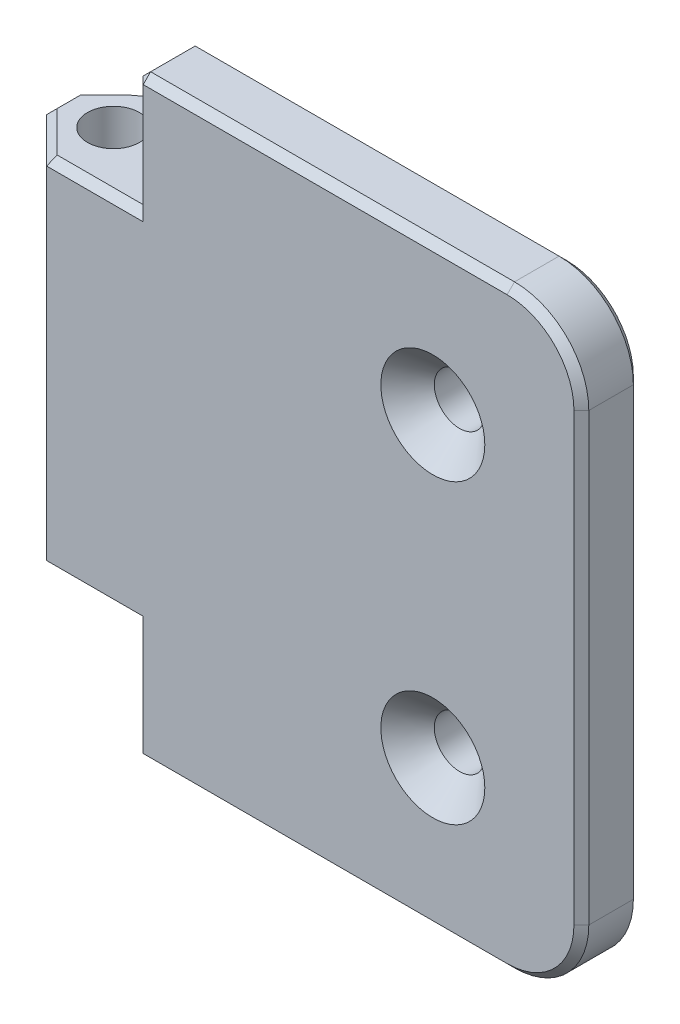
ISO-10303-21;
HEADER;
FILE_DESCRIPTION(('STEP AP214'),'2;1');
FILE_NAME('part.step','',(''),(''),'','','');
FILE_SCHEMA(('AUTOMOTIVE_DESIGN { 1 0 10303 214 1 1 1 1 }'));
ENDSEC;
DATA;
#1=APPLICATION_CONTEXT('core data for automotive mechanical design processes');
#2=APPLICATION_PROTOCOL_DEFINITION('international standard','automotive_design',2000,#1);
#3=PRODUCT_CONTEXT('',#1,'mechanical');
#4=PRODUCT('Part','Part','',(#3));
#5=PRODUCT_RELATED_PRODUCT_CATEGORY('part','',(#4));
#6=PRODUCT_DEFINITION_FORMATION('','',#4);
#7=PRODUCT_DEFINITION_CONTEXT('part definition',#1,'design');
#8=PRODUCT_DEFINITION('design','',#6,#7);
#9=PRODUCT_DEFINITION_SHAPE('','',#8);
#10=(LENGTH_UNIT() NAMED_UNIT(*) SI_UNIT(.MILLI.,.METRE.));
#11=(NAMED_UNIT(*) PLANE_ANGLE_UNIT() SI_UNIT($,.RADIAN.));
#12=(NAMED_UNIT(*) SI_UNIT($,.STERADIAN.) SOLID_ANGLE_UNIT());
#13=UNCERTAINTY_MEASURE_WITH_UNIT(LENGTH_MEASURE(1.E-05),#10,'distance_accuracy_value','');
#14=(GEOMETRIC_REPRESENTATION_CONTEXT(3) GLOBAL_UNCERTAINTY_ASSIGNED_CONTEXT((#13)) GLOBAL_UNIT_ASSIGNED_CONTEXT((#10,
#11,#12)) REPRESENTATION_CONTEXT('',''));
#15=CARTESIAN_POINT('',(0.,0.,0.));
#16=DIRECTION('',(0.,0.,1.));
#17=DIRECTION('',(1.,0.,0.));
#18=AXIS2_PLACEMENT_3D('',#15,#16,#17);
#19=CARTESIAN_POINT('',(0.,0.,-8.));
#20=DIRECTION('',(1.,0.,0.));
#21=DIRECTION('',(0.,0.,-1.));
#22=AXIS2_PLACEMENT_3D('',#19,#20,#21);
#23=PLANE('',#22);
#24=DIRECTION('',(0.,0.,1.));
#25=VECTOR('',#24,1.);
#26=CARTESIAN_POINT('',(0.,-35.,-8.));
#27=LINE('',#26,#25);
#28=CARTESIAN_POINT('',(0.,-35.,-0.500000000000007));
#29=VERTEX_POINT('',#28);
#30=CARTESIAN_POINT('',(0.,-35.,-3.49999999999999));
#31=VERTEX_POINT('',#30);
#32=EDGE_CURVE('E630',#29,#31,#27,.F.);
#33=ORIENTED_EDGE('',*,*,#32,.T.);
#34=DIRECTION('',(0.,1.,0.));
#35=VECTOR('',#34,1.);
#36=CARTESIAN_POINT('',(0.,-5.,-3.49999999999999));
#37=LINE('',#36,#35);
#38=CARTESIAN_POINT('',(0.,-5.,-3.49999999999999));
#39=VERTEX_POINT('',#38);
#40=EDGE_CURVE('E334',#31,#39,#37,.T.);
#41=ORIENTED_EDGE('',*,*,#40,.T.);
#42=DIRECTION('',(0.,0.,1.));
#43=VECTOR('',#42,1.);
#44=CARTESIAN_POINT('',(0.,-5.,-8.));
#45=LINE('',#44,#43);
#46=CARTESIAN_POINT('',(0.,-5.,-0.500000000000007));
#47=VERTEX_POINT('',#46);
#48=EDGE_CURVE('E627',#39,#47,#45,.T.);
#49=ORIENTED_EDGE('',*,*,#48,.T.);
#50=DIRECTION('',(0.,-1.,0.));
#51=VECTOR('',#50,1.);
#52=CARTESIAN_POINT('',(0.,-35.,-0.500000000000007));
#53=LINE('',#52,#51);
#54=EDGE_CURVE('E332',#47,#29,#53,.T.);
#55=ORIENTED_EDGE('',*,*,#54,.T.);
#56=EDGE_LOOP('',(#33,#41,#49,#55));
#57=FACE_BOUND('',#56,.T.);
#58=ADVANCED_FACE('F36',(#57),#23,.T.);
#59=CARTESIAN_POINT('',(0.,-40.,-8.));
#60=DIRECTION('',(0.,-1.,0.));
#61=DIRECTION('',(1.,0.,0.));
#62=AXIS2_PLACEMENT_3D('',#59,#60,#61);
#63=PLANE('',#62);
#64=DIRECTION('',(0.,0.,-1.));
#65=VECTOR('',#64,1.);
#66=CARTESIAN_POINT('',(-29.5,-40.,-4.));
#67=LINE('',#66,#65);
#68=CARTESIAN_POINT('',(-29.5,-40.,-0.500000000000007));
#69=VERTEX_POINT('',#68);
#70=CARTESIAN_POINT('',(-29.5,-40.,-3.49999999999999));
#71=VERTEX_POINT('',#70);
#72=EDGE_CURVE('E551',#69,#71,#67,.T.);
#73=ORIENTED_EDGE('',*,*,#72,.T.);
#74=DIRECTION('',(1.,0.,0.));
#75=VECTOR('',#74,1.);
#76=CARTESIAN_POINT('',(-5.,-40.,-3.49999999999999));
#77=LINE('',#76,#75);
#78=CARTESIAN_POINT('',(-5.,-40.,-3.49999999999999));
#79=VERTEX_POINT('',#78);
#80=EDGE_CURVE('E554',#71,#79,#77,.T.);
#81=ORIENTED_EDGE('',*,*,#80,.T.);
#82=DIRECTION('',(0.,0.,1.));
#83=VECTOR('',#82,1.);
#84=CARTESIAN_POINT('',(-5.,-40.,-8.));
#85=LINE('',#84,#83);
#86=CARTESIAN_POINT('',(-5.,-40.,-0.500000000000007));
#87=VERTEX_POINT('',#86);
#88=EDGE_CURVE('E479',#79,#87,#85,.T.);
#89=ORIENTED_EDGE('',*,*,#88,.T.);
#90=DIRECTION('',(-1.,0.,0.));
#91=VECTOR('',#90,1.);
#92=CARTESIAN_POINT('',(-30.,-40.,-0.500000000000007));
#93=LINE('',#92,#91);
#94=EDGE_CURVE('E549',#87,#69,#93,.T.);
#95=ORIENTED_EDGE('',*,*,#94,.T.);
#96=EDGE_LOOP('',(#73,#81,#89,#95));
#97=FACE_BOUND('',#96,.T.);
#98=ADVANCED_FACE('F658',(#97),#63,.T.);
#99=CARTESIAN_POINT('',(-39.,0.,-8.));
#100=DIRECTION('',(-1.,0.,0.));
#101=DIRECTION('',(0.,-1.,0.));
#102=AXIS2_PLACEMENT_3D('',#99,#100,#101);
#103=PLANE('',#102);
#104=DIRECTION('',(0.,-1.,0.));
#105=VECTOR('',#104,1.);
#106=CARTESIAN_POINT('',(-39.,0.,-5.));
#107=LINE('',#106,#105);
#108=CARTESIAN_POINT('',(-39.,-8.50000000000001,-5.));
#109=VERTEX_POINT('',#108);
#110=CARTESIAN_POINT('',(-39.,-31.5,-5.));
#111=VERTEX_POINT('',#110);
#112=EDGE_CURVE('E261',#109,#111,#107,.T.);
#113=ORIENTED_EDGE('',*,*,#112,.T.);
#114=DIRECTION('',(0.,0.,1.));
#115=VECTOR('',#114,1.);
#116=CARTESIAN_POINT('',(-39.,-31.5,-3.));
#117=LINE('',#116,#115);
#118=CARTESIAN_POINT('',(-39.,-31.5,-3.));
#119=VERTEX_POINT('',#118);
#120=EDGE_CURVE('E269',#111,#119,#117,.T.);
#121=ORIENTED_EDGE('',*,*,#120,.T.);
#122=DIRECTION('',(0.,1.,0.));
#123=VECTOR('',#122,1.);
#124=CARTESIAN_POINT('',(-39.,-8.,-3.));
#125=LINE('',#124,#123);
#126=CARTESIAN_POINT('',(-39.,-8.50000000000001,-3.));
#127=VERTEX_POINT('',#126);
#128=EDGE_CURVE('E264',#119,#127,#125,.T.);
#129=ORIENTED_EDGE('',*,*,#128,.T.);
#130=DIRECTION('',(0.,0.,-1.));
#131=VECTOR('',#130,1.);
#132=CARTESIAN_POINT('',(-39.,-8.50000000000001,-5.));
#133=LINE('',#132,#131);
#134=EDGE_CURVE('E257',#127,#109,#133,.T.);
#135=ORIENTED_EDGE('',*,*,#134,.T.);
#136=EDGE_LOOP('',(#113,#121,#129,#135));
#137=FACE_BOUND('',#136,.T.);
#138=ADVANCED_FACE('F259',(#137),#103,.T.);
#139=CARTESIAN_POINT('',(0.,0.,-8.));
#140=DIRECTION('',(0.,1.,0.));
#141=DIRECTION('',(-1.,0.,0.));
#142=AXIS2_PLACEMENT_3D('',#139,#140,#141);
#143=PLANE('',#142);
#144=DIRECTION('',(0.,0.,1.));
#145=VECTOR('',#144,1.);
#146=CARTESIAN_POINT('',(-5.,0.,-8.));
#147=LINE('',#146,#145);
#148=CARTESIAN_POINT('',(-5.,0.,-0.500000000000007));
#149=VERTEX_POINT('',#148);
#150=CARTESIAN_POINT('',(-5.,0.,-3.49999999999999));
#151=VERTEX_POINT('',#150);
#152=EDGE_CURVE('E633',#149,#151,#147,.F.);
#153=ORIENTED_EDGE('',*,*,#152,.T.);
#154=DIRECTION('',(-1.,0.,0.));
#155=VECTOR('',#154,1.);
#156=CARTESIAN_POINT('',(-30.,0.,-3.49999999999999));
#157=LINE('',#156,#155);
#158=CARTESIAN_POINT('',(-29.5,0.,-3.49999999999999));
#159=VERTEX_POINT('',#158);
#160=EDGE_CURVE('E350',#151,#159,#157,.T.);
#161=ORIENTED_EDGE('',*,*,#160,.T.);
#162=DIRECTION('',(0.,0.,1.));
#163=VECTOR('',#162,1.);
#164=CARTESIAN_POINT('',(-29.5,0.,0.));
#165=LINE('',#164,#163);
#166=CARTESIAN_POINT('',(-29.5,0.,-0.500000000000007));
#167=VERTEX_POINT('',#166);
#168=EDGE_CURVE('E348',#159,#167,#165,.T.);
#169=ORIENTED_EDGE('',*,*,#168,.T.);
#170=DIRECTION('',(1.,0.,0.));
#171=VECTOR('',#170,1.);
#172=CARTESIAN_POINT('',(-5.,0.,-0.500000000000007));
#173=LINE('',#172,#171);
#174=EDGE_CURVE('E346',#167,#149,#173,.T.);
#175=ORIENTED_EDGE('',*,*,#174,.T.);
#176=EDGE_LOOP('',(#153,#161,#169,#175));
#177=FACE_BOUND('',#176,.T.);
#178=ADVANCED_FACE('F668',(#177),#143,.T.);
#179=CARTESIAN_POINT('',(0.,0.,-8.));
#180=DIRECTION('',(0.,0.,-1.));
#181=DIRECTION('',(-1.,0.,0.));
#182=AXIS2_PLACEMENT_3D('',#179,#180,#181);
#183=PLANE('',#182);
#184=DIRECTION('',(0.,-1.,0.));
#185=VECTOR('',#184,1.);
#186=CARTESIAN_POINT('',(-30.5,-32.,-8.));
#187=LINE('',#186,#185);
#188=CARTESIAN_POINT('',(-30.5,-8.50000000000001,-8.));
#189=VERTEX_POINT('',#188);
#190=CARTESIAN_POINT('',(-30.5,-31.5,-8.));
#191=VERTEX_POINT('',#190);
#192=EDGE_CURVE('E319',#189,#191,#187,.T.);
#193=ORIENTED_EDGE('',*,*,#192,.T.);
#194=DIRECTION('',(-1.,0.,0.));
#195=VECTOR('',#194,1.);
#196=CARTESIAN_POINT('',(-33.9289321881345,-31.5,-8.));
#197=LINE('',#196,#195);
#198=CARTESIAN_POINT('',(-33.9289321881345,-31.5,-8.));
#199=VERTEX_POINT('',#198);
#200=EDGE_CURVE('E323',#191,#199,#197,.T.);
#201=ORIENTED_EDGE('',*,*,#200,.T.);
#202=DIRECTION('',(0.,-1.,0.));
#203=VECTOR('',#202,1.);
#204=CARTESIAN_POINT('',(-33.9289321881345,0.,-8.));
#205=LINE('',#204,#203);
#206=CARTESIAN_POINT('',(-33.9289321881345,-8.50000000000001,-8.));
#207=VERTEX_POINT('',#206);
#208=EDGE_CURVE('E500',#199,#207,#205,.F.);
#209=ORIENTED_EDGE('',*,*,#208,.T.);
#210=DIRECTION('',(1.,0.,0.));
#211=VECTOR('',#210,1.);
#212=CARTESIAN_POINT('',(-30.,-8.50000000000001,-8.));
#213=LINE('',#212,#211);
#214=EDGE_CURVE('E321',#207,#189,#213,.T.);
#215=ORIENTED_EDGE('',*,*,#214,.T.);
#216=EDGE_LOOP('',(#193,#201,#209,#215));
#217=FACE_BOUND('',#216,.T.);
#218=ADVANCED_FACE('F499',(#217),#183,.T.);
#219=CARTESIAN_POINT('',(0.,0.,0.));
#220=DIRECTION('',(0.,0.,-1.));
#221=DIRECTION('',(-1.,0.,0.));
#222=AXIS2_PLACEMENT_3D('',#219,#220,#221);
#223=PLANE('',#222);
#224=DIRECTION('',(0.,-1.,0.));
#225=VECTOR('',#224,1.);
#226=CARTESIAN_POINT('',(-36.,-32.,0.));
#227=LINE('',#226,#225);
#228=CARTESIAN_POINT('',(-36.,-8.50000000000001,0.));
#229=VERTEX_POINT('',#228);
#230=CARTESIAN_POINT('',(-36.,-31.5,0.));
#231=VERTEX_POINT('',#230);
#232=EDGE_CURVE('E280',#229,#231,#227,.T.);
#233=ORIENTED_EDGE('',*,*,#232,.T.);
#234=DIRECTION('',(1.,0.,0.));
#235=VECTOR('',#234,1.);
#236=CARTESIAN_POINT('',(0.,-31.5,0.));
#237=LINE('',#236,#235);
#238=CARTESIAN_POINT('',(-29.5,-31.5,0.));
#239=VERTEX_POINT('',#238);
#240=EDGE_CURVE('E297',#231,#239,#237,.T.);
#241=ORIENTED_EDGE('',*,*,#240,.T.);
#242=DIRECTION('',(0.,-1.,0.));
#243=VECTOR('',#242,1.);
#244=CARTESIAN_POINT('',(-29.5,0.,0.));
#245=LINE('',#244,#243);
#246=CARTESIAN_POINT('',(-29.5,-39.5,0.));
#247=VERTEX_POINT('',#246);
#248=EDGE_CURVE('E301',#239,#247,#245,.T.);
#249=ORIENTED_EDGE('',*,*,#248,.T.);
#250=DIRECTION('',(1.,0.,0.));
#251=VECTOR('',#250,1.);
#252=CARTESIAN_POINT('',(-5.,-39.5,0.));
#253=LINE('',#252,#251);
#254=CARTESIAN_POINT('',(-5.,-39.5,0.));
#255=VERTEX_POINT('',#254);
#256=EDGE_CURVE('E568',#247,#255,#253,.T.);
#257=ORIENTED_EDGE('',*,*,#256,.T.);
#258=CARTESIAN_POINT('',(-5.,-35.,0.));
#259=DIRECTION('',(0.,0.,-1.));
#260=DIRECTION('',(-1.,0.,0.));
#261=AXIS2_PLACEMENT_3D('',#258,#259,#260);
#262=CIRCLE('',#261,4.49999999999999);
#263=CARTESIAN_POINT('',(-0.500000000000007,-35.,0.));
#264=VERTEX_POINT('',#263);
#265=EDGE_CURVE('E566',#255,#264,#262,.F.);
#266=ORIENTED_EDGE('',*,*,#265,.T.);
#267=DIRECTION('',(0.,1.,0.));
#268=VECTOR('',#267,1.);
#269=CARTESIAN_POINT('',(-0.500000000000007,-5.,0.));
#270=LINE('',#269,#268);
#271=CARTESIAN_POINT('',(-0.500000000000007,-5.,0.));
#272=VERTEX_POINT('',#271);
#273=EDGE_CURVE('E564',#264,#272,#270,.T.);
#274=ORIENTED_EDGE('',*,*,#273,.T.);
#275=CARTESIAN_POINT('',(-5.,-5.,0.));
#276=DIRECTION('',(0.,0.,-1.));
#277=DIRECTION('',(-1.,0.,0.));
#278=AXIS2_PLACEMENT_3D('',#275,#276,#277);
#279=CIRCLE('',#278,4.49999999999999);
#280=CARTESIAN_POINT('',(-5.,-0.500000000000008,0.));
#281=VERTEX_POINT('',#280);
#282=EDGE_CURVE('E562',#272,#281,#279,.F.);
#283=ORIENTED_EDGE('',*,*,#282,.T.);
#284=DIRECTION('',(-1.,0.,0.));
#285=VECTOR('',#284,1.);
#286=CARTESIAN_POINT('',(-30.,-0.500000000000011,0.));
#287=LINE('',#286,#285);
#288=CARTESIAN_POINT('',(-29.5,-0.500000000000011,0.));
#289=VERTEX_POINT('',#288);
#290=EDGE_CURVE('E556',#281,#289,#287,.T.);
#291=ORIENTED_EDGE('',*,*,#290,.T.);
#292=DIRECTION('',(0.,-1.,0.));
#293=VECTOR('',#292,1.);
#294=CARTESIAN_POINT('',(-29.5,0.,0.));
#295=LINE('',#294,#293);
#296=CARTESIAN_POINT('',(-29.5,-8.50000000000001,0.));
#297=VERTEX_POINT('',#296);
#298=EDGE_CURVE('E558',#289,#297,#295,.T.);
#299=ORIENTED_EDGE('',*,*,#298,.T.);
#300=DIRECTION('',(-1.,0.,0.));
#301=VECTOR('',#300,1.);
#302=CARTESIAN_POINT('',(0.,-8.50000000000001,0.));
#303=LINE('',#302,#301);
#304=EDGE_CURVE('E560',#297,#229,#303,.T.);
#305=ORIENTED_EDGE('',*,*,#304,.T.);
#306=EDGE_LOOP('',(#233,#241,#249,#257,#266,#274,#283,#291,#299,#305));
#307=FACE_BOUND('',#306,.T.);
#308=CARTESIAN_POINT('',(-10.,-10.,0.));
#309=DIRECTION('',(0.,0.,1.));
#310=DIRECTION('',(1.,0.,0.));
#311=AXIS2_PLACEMENT_3D('',#308,#309,#310);
#312=CIRCLE('',#311,3.5);
#313=CARTESIAN_POINT('',(-6.5,-10.,0.));
#314=VERTEX_POINT('',#313);
#315=EDGE_CURVE('E607',#314,#314,#312,.T.);
#316=ORIENTED_EDGE('',*,*,#315,.F.);
#317=EDGE_LOOP('',(#316));
#318=FACE_BOUND('',#317,.T.);
#319=CARTESIAN_POINT('',(-10.,-30.,0.));
#320=DIRECTION('',(0.,0.,1.));
#321=DIRECTION('',(1.,0.,0.));
#322=AXIS2_PLACEMENT_3D('',#319,#320,#321);
#323=CIRCLE('',#322,3.5);
#324=CARTESIAN_POINT('',(-6.5,-30.,0.));
#325=VERTEX_POINT('',#324);
#326=EDGE_CURVE('E615',#325,#325,#323,.T.);
#327=ORIENTED_EDGE('',*,*,#326,.F.);
#328=EDGE_LOOP('',(#327));
#329=FACE_BOUND('',#328,.T.);
#330=ADVANCED_FACE('F572',(#307,#318,#329),#223,.F.);
#331=CARTESIAN_POINT('',(0.,-40.,-4.));
#332=DIRECTION('',(0.,0.,1.));
#333=DIRECTION('',(1.,0.,0.));
#334=AXIS2_PLACEMENT_3D('',#331,#332,#333);
#335=PLANE('',#334);
#336=CARTESIAN_POINT('',(-10.,-10.,-4.));
#337=DIRECTION('',(0.,0.,1.));
#338=DIRECTION('',(1.,0.,0.));
#339=AXIS2_PLACEMENT_3D('',#336,#337,#338);
#340=CIRCLE('',#339,1.7);
#341=CARTESIAN_POINT('',(-8.3,-10.,-4.));
#342=VERTEX_POINT('',#341);
#343=EDGE_CURVE('E614',#342,#342,#340,.T.);
#344=ORIENTED_EDGE('',*,*,#343,.T.);
#345=EDGE_LOOP('',(#344));
#346=FACE_BOUND('',#345,.T.);
#347=CARTESIAN_POINT('',(-10.,-30.,-4.));
#348=DIRECTION('',(0.,0.,1.));
#349=DIRECTION('',(1.,0.,0.));
#350=AXIS2_PLACEMENT_3D('',#347,#348,#349);
#351=CIRCLE('',#350,1.7);
#352=CARTESIAN_POINT('',(-8.3,-30.,-4.));
#353=VERTEX_POINT('',#352);
#354=EDGE_CURVE('E480',#353,#353,#351,.T.);
#355=ORIENTED_EDGE('',*,*,#354,.T.);
#356=EDGE_LOOP('',(#355));
#357=FACE_BOUND('',#356,.T.);
#358=DIRECTION('',(0.,1.,0.));
#359=VECTOR('',#358,1.);
#360=CARTESIAN_POINT('',(-29.5,-40.,-4.));
#361=LINE('',#360,#359);
#362=CARTESIAN_POINT('',(-29.5,-39.5,-4.));
#363=VERTEX_POINT('',#362);
#364=CARTESIAN_POINT('',(-29.5,-32.,-4.));
#365=VERTEX_POINT('',#364);
#366=EDGE_CURVE('E539',#363,#365,#361,.T.);
#367=ORIENTED_EDGE('',*,*,#366,.T.);
#368=DIRECTION('',(-1.,0.,0.));
#369=VECTOR('',#368,1.);
#370=CARTESIAN_POINT('',(0.,-32.,-4.));
#371=LINE('',#370,#369);
#372=CARTESIAN_POINT('',(-30.5,-32.,-4.));
#373=VERTEX_POINT('',#372);
#374=EDGE_CURVE('E471',#365,#373,#371,.T.);
#375=ORIENTED_EDGE('',*,*,#374,.T.);
#376=DIRECTION('',(-0.707106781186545,-0.70710678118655,0.));
#377=VECTOR('',#376,1.);
#378=CARTESIAN_POINT('',(-19.2500000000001,-20.75,-4.));
#379=LINE('',#378,#377);
#380=CARTESIAN_POINT('',(-30.,-31.5,-4.));
#381=VERTEX_POINT('',#380);
#382=EDGE_CURVE('E45',#373,#381,#379,.F.);
#383=ORIENTED_EDGE('',*,*,#382,.T.);
#384=DIRECTION('',(0.,1.,0.));
#385=VECTOR('',#384,1.);
#386=CARTESIAN_POINT('',(-30.,-40.,-4.));
#387=LINE('',#386,#385);
#388=CARTESIAN_POINT('',(-30.,-8.49999999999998,-4.));
#389=VERTEX_POINT('',#388);
#390=EDGE_CURVE('E470',#381,#389,#387,.T.);
#391=ORIENTED_EDGE('',*,*,#390,.T.);
#392=DIRECTION('',(0.707106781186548,-0.707106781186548,0.));
#393=VECTOR('',#392,1.);
#394=CARTESIAN_POINT('',(0.750000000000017,-39.25,-4.));
#395=LINE('',#394,#393);
#396=CARTESIAN_POINT('',(-30.5,-8.,-4.));
#397=VERTEX_POINT('',#396);
#398=EDGE_CURVE('E11',#389,#397,#395,.F.);
#399=ORIENTED_EDGE('',*,*,#398,.T.);
#400=DIRECTION('',(1.,0.,0.));
#401=VECTOR('',#400,1.);
#402=CARTESIAN_POINT('',(0.,-8.,-4.));
#403=LINE('',#402,#401);
#404=CARTESIAN_POINT('',(-29.5,-8.,-4.));
#405=VERTEX_POINT('',#404);
#406=EDGE_CURVE('E52',#397,#405,#403,.T.);
#407=ORIENTED_EDGE('',*,*,#406,.T.);
#408=DIRECTION('',(0.,1.,0.));
#409=VECTOR('',#408,1.);
#410=CARTESIAN_POINT('',(-29.5,-40.,-4.));
#411=LINE('',#410,#409);
#412=CARTESIAN_POINT('',(-29.5,-0.500000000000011,-4.));
#413=VERTEX_POINT('',#412);
#414=EDGE_CURVE('E529',#405,#413,#411,.T.);
#415=ORIENTED_EDGE('',*,*,#414,.T.);
#416=DIRECTION('',(1.,0.,0.));
#417=VECTOR('',#416,1.);
#418=CARTESIAN_POINT('',(-5.,-0.500000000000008,-4.));
#419=LINE('',#418,#417);
#420=CARTESIAN_POINT('',(-5.,-0.500000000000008,-4.));
#421=VERTEX_POINT('',#420);
#422=EDGE_CURVE('E527',#413,#421,#419,.T.);
#423=ORIENTED_EDGE('',*,*,#422,.T.);
#424=CARTESIAN_POINT('',(-5.,-5.,-4.));
#425=DIRECTION('',(0.,0.,1.));
#426=DIRECTION('',(1.,0.,0.));
#427=AXIS2_PLACEMENT_3D('',#424,#425,#426);
#428=CIRCLE('',#427,4.49999999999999);
#429=CARTESIAN_POINT('',(-0.500000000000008,-5.,-4.));
#430=VERTEX_POINT('',#429);
#431=EDGE_CURVE('E531',#421,#430,#428,.F.);
#432=ORIENTED_EDGE('',*,*,#431,.T.);
#433=DIRECTION('',(0.,-1.,0.));
#434=VECTOR('',#433,1.);
#435=CARTESIAN_POINT('',(-0.500000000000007,-35.,-4.));
#436=LINE('',#435,#434);
#437=CARTESIAN_POINT('',(-0.500000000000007,-35.,-4.));
#438=VERTEX_POINT('',#437);
#439=EDGE_CURVE('E533',#430,#438,#436,.T.);
#440=ORIENTED_EDGE('',*,*,#439,.T.);
#441=CARTESIAN_POINT('',(-5.,-35.,-4.));
#442=DIRECTION('',(0.,0.,1.));
#443=DIRECTION('',(1.,0.,0.));
#444=AXIS2_PLACEMENT_3D('',#441,#442,#443);
#445=CIRCLE('',#444,4.49999999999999);
#446=CARTESIAN_POINT('',(-5.,-39.5,-4.));
#447=VERTEX_POINT('',#446);
#448=EDGE_CURVE('E535',#438,#447,#445,.F.);
#449=ORIENTED_EDGE('',*,*,#448,.T.);
#450=DIRECTION('',(-1.,0.,0.));
#451=VECTOR('',#450,1.);
#452=CARTESIAN_POINT('',(-30.,-39.5,-4.));
#453=LINE('',#452,#451);
#454=EDGE_CURVE('E537',#447,#363,#453,.T.);
#455=ORIENTED_EDGE('',*,*,#454,.T.);
#456=EDGE_LOOP('',(#367,#375,#383,#391,#399,#407,#415,#423,#432,#440,#449,#455));
#457=FACE_BOUND('',#456,.T.);
#458=ADVANCED_FACE('F469',(#346,#357,#457),#335,.F.);
#459=CARTESIAN_POINT('',(-30.,-40.,-8.));
#460=DIRECTION('',(-1.,0.,0.));
#461=DIRECTION('',(0.,-1.,0.));
#462=AXIS2_PLACEMENT_3D('',#459,#460,#461);
#463=PLANE('',#462);
#464=ORIENTED_EDGE('',*,*,#390,.F.);
#465=DIRECTION('',(0.,0.,-1.));
#466=VECTOR('',#465,1.);
#467=CARTESIAN_POINT('',(-30.,-31.5,-8.));
#468=LINE('',#467,#466);
#469=CARTESIAN_POINT('',(-30.,-31.5,-7.49999999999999));
#470=VERTEX_POINT('',#469);
#471=EDGE_CURVE('E454',#381,#470,#468,.T.);
#472=ORIENTED_EDGE('',*,*,#471,.T.);
#473=DIRECTION('',(0.,1.,0.));
#474=VECTOR('',#473,1.);
#475=CARTESIAN_POINT('',(-30.,-8.,-7.49999999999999));
#476=LINE('',#475,#474);
#477=CARTESIAN_POINT('',(-30.,-8.49999999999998,-7.49999999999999));
#478=VERTEX_POINT('',#477);
#479=EDGE_CURVE('E325',#470,#478,#476,.T.);
#480=ORIENTED_EDGE('',*,*,#479,.T.);
#481=DIRECTION('',(0.,0.,1.));
#482=VECTOR('',#481,1.);
#483=CARTESIAN_POINT('',(-30.,-8.49999999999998,-8.));
#484=LINE('',#483,#482);
#485=EDGE_CURVE('E451',#478,#389,#484,.T.);
#486=ORIENTED_EDGE('',*,*,#485,.T.);
#487=EDGE_LOOP('',(#464,#472,#480,#486));
#488=FACE_BOUND('',#487,.T.);
#489=ADVANCED_FACE('F476',(#488),#463,.F.);
#490=CARTESIAN_POINT('',(-10.,-30.,0.));
#491=DIRECTION('',(0.,0.,1.));
#492=DIRECTION('',(1.,0.,0.));
#493=AXIS2_PLACEMENT_3D('',#490,#491,#492);
#494=CYLINDRICAL_SURFACE('',#493,1.7);
#495=CARTESIAN_POINT('',(-10.,-30.,-1.8));
#496=DIRECTION('',(0.,0.,1.));
#497=DIRECTION('',(1.,0.,0.));
#498=AXIS2_PLACEMENT_3D('',#495,#496,#497);
#499=CIRCLE('',#498,1.7);
#500=CARTESIAN_POINT('',(-8.3,-30.,-1.8));
#501=VERTEX_POINT('',#500);
#502=EDGE_CURVE('E618',#501,#501,#499,.T.);
#503=ORIENTED_EDGE('',*,*,#502,.T.);
#504=EDGE_LOOP('',(#503));
#505=FACE_BOUND('',#504,.T.);
#506=ORIENTED_EDGE('',*,*,#354,.F.);
#507=EDGE_LOOP('',(#506));
#508=FACE_BOUND('',#507,.T.);
#509=ADVANCED_FACE('F993',(#505,#508),#494,.F.);
#510=CARTESIAN_POINT('',(-10.,-30.,0.));
#511=DIRECTION('',(0.,0.,1.));
#512=DIRECTION('',(1.,0.,0.));
#513=AXIS2_PLACEMENT_3D('',#510,#511,#512);
#514=CONICAL_SURFACE('',#513,3.5,0.785398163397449);
#515=ORIENTED_EDGE('',*,*,#502,.F.);
#516=EDGE_LOOP('',(#515));
#517=FACE_BOUND('',#516,.T.);
#518=ORIENTED_EDGE('',*,*,#326,.T.);
#519=EDGE_LOOP('',(#518));
#520=FACE_BOUND('',#519,.T.);
#521=ADVANCED_FACE('F999',(#517,#520),#514,.F.);
#522=CARTESIAN_POINT('',(-10.,-10.,0.));
#523=DIRECTION('',(0.,0.,1.));
#524=DIRECTION('',(1.,0.,0.));
#525=AXIS2_PLACEMENT_3D('',#522,#523,#524);
#526=CYLINDRICAL_SURFACE('',#525,1.7);
#527=CARTESIAN_POINT('',(-10.,-10.,-1.8));
#528=DIRECTION('',(0.,0.,1.));
#529=DIRECTION('',(1.,0.,0.));
#530=AXIS2_PLACEMENT_3D('',#527,#528,#529);
#531=CIRCLE('',#530,1.7);
#532=CARTESIAN_POINT('',(-8.3,-10.,-1.8));
#533=VERTEX_POINT('',#532);
#534=EDGE_CURVE('E610',#533,#533,#531,.T.);
#535=ORIENTED_EDGE('',*,*,#534,.T.);
#536=EDGE_LOOP('',(#535));
#537=FACE_BOUND('',#536,.T.);
#538=ORIENTED_EDGE('',*,*,#343,.F.);
#539=EDGE_LOOP('',(#538));
#540=FACE_BOUND('',#539,.T.);
#541=ADVANCED_FACE('F1003',(#537,#540),#526,.F.);
#542=CARTESIAN_POINT('',(-10.,-10.,0.));
#543=DIRECTION('',(0.,0.,1.));
#544=DIRECTION('',(1.,0.,0.));
#545=AXIS2_PLACEMENT_3D('',#542,#543,#544);
#546=CONICAL_SURFACE('',#545,3.5,0.785398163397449);
#547=ORIENTED_EDGE('',*,*,#534,.F.);
#548=EDGE_LOOP('',(#547));
#549=FACE_BOUND('',#548,.T.);
#550=ORIENTED_EDGE('',*,*,#315,.T.);
#551=EDGE_LOOP('',(#550));
#552=FACE_BOUND('',#551,.T.);
#553=ADVANCED_FACE('F674',(#549,#552),#546,.F.);
#554=CARTESIAN_POINT('',(-5.,-35.,-8.));
#555=DIRECTION('',(0.,0.,1.));
#556=DIRECTION('',(1.,0.,0.));
#557=AXIS2_PLACEMENT_3D('',#554,#555,#556);
#558=CYLINDRICAL_SURFACE('',#557,5.);
#559=ORIENTED_EDGE('',*,*,#88,.F.);
#560=CARTESIAN_POINT('',(-5.,-35.,-3.49999999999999));
#561=DIRECTION('',(0.,0.,1.));
#562=DIRECTION('',(1.,0.,0.));
#563=AXIS2_PLACEMENT_3D('',#560,#561,#562);
#564=CIRCLE('',#563,5.);
#565=EDGE_CURVE('E330',#79,#31,#564,.T.);
#566=ORIENTED_EDGE('',*,*,#565,.T.);
#567=ORIENTED_EDGE('',*,*,#32,.F.);
#568=CARTESIAN_POINT('',(-5.,-35.,-0.500000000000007));
#569=DIRECTION('',(0.,0.,-1.));
#570=DIRECTION('',(-1.,0.,0.));
#571=AXIS2_PLACEMENT_3D('',#568,#569,#570);
#572=CIRCLE('',#571,5.);
#573=EDGE_CURVE('E328',#29,#87,#572,.T.);
#574=ORIENTED_EDGE('',*,*,#573,.T.);
#575=EDGE_LOOP('',(#559,#566,#567,#574));
#576=FACE_BOUND('',#575,.T.);
#577=ADVANCED_FACE('F670',(#576),#558,.T.);
#578=CARTESIAN_POINT('',(-5.,-5.,-8.));
#579=DIRECTION('',(0.,0.,1.));
#580=DIRECTION('',(1.,0.,0.));
#581=AXIS2_PLACEMENT_3D('',#578,#579,#580);
#582=CYLINDRICAL_SURFACE('',#581,5.);
#583=ORIENTED_EDGE('',*,*,#48,.F.);
#584=CARTESIAN_POINT('',(-5.,-5.,-3.49999999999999));
#585=DIRECTION('',(0.,0.,1.));
#586=DIRECTION('',(1.,0.,0.));
#587=AXIS2_PLACEMENT_3D('',#584,#585,#586);
#588=CIRCLE('',#587,5.);
#589=EDGE_CURVE('E338',#39,#151,#588,.T.);
#590=ORIENTED_EDGE('',*,*,#589,.T.);
#591=ORIENTED_EDGE('',*,*,#152,.F.);
#592=CARTESIAN_POINT('',(-5.,-5.,-0.500000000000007));
#593=DIRECTION('',(0.,0.,-1.));
#594=DIRECTION('',(-1.,0.,0.));
#595=AXIS2_PLACEMENT_3D('',#592,#593,#594);
#596=CIRCLE('',#595,5.);
#597=EDGE_CURVE('E336',#149,#47,#596,.T.);
#598=ORIENTED_EDGE('',*,*,#597,.T.);
#599=EDGE_LOOP('',(#583,#590,#591,#598));
#600=FACE_BOUND('',#599,.T.);
#601=ADVANCED_FACE('F673',(#600),#582,.T.);
#602=CARTESIAN_POINT('',(-30.,-40.,-8.));
#603=DIRECTION('',(1.,0.,0.));
#604=DIRECTION('',(0.,0.,-1.));
#605=AXIS2_PLACEMENT_3D('',#602,#603,#604);
#606=PLANE('',#605);
#607=DIRECTION('',(0.,0.,1.));
#608=VECTOR('',#607,1.);
#609=CARTESIAN_POINT('',(-30.,-32.,-8.));
#610=LINE('',#609,#608);
#611=CARTESIAN_POINT('',(-30.,-32.,-3.5));
#612=VERTEX_POINT('',#611);
#613=CARTESIAN_POINT('',(-30.,-32.,-0.5));
#614=VERTEX_POINT('',#613);
#615=EDGE_CURVE('E448',#612,#614,#610,.T.);
#616=ORIENTED_EDGE('',*,*,#615,.F.);
#617=DIRECTION('',(0.,-1.,0.));
#618=VECTOR('',#617,1.);
#619=CARTESIAN_POINT('',(-30.,-40.,-3.5));
#620=LINE('',#619,#618);
#621=CARTESIAN_POINT('',(-30.,-39.5,-3.5));
#622=VERTEX_POINT('',#621);
#623=EDGE_CURVE('E547',#612,#622,#620,.T.);
#624=ORIENTED_EDGE('',*,*,#623,.T.);
#625=DIRECTION('',(0.,0.,1.));
#626=VECTOR('',#625,1.);
#627=CARTESIAN_POINT('',(-30.,-39.5,0.));
#628=LINE('',#627,#626);
#629=CARTESIAN_POINT('',(-30.,-39.5,-0.5));
#630=VERTEX_POINT('',#629);
#631=EDGE_CURVE('E545',#622,#630,#628,.T.);
#632=ORIENTED_EDGE('',*,*,#631,.T.);
#633=DIRECTION('',(0.,1.,0.));
#634=VECTOR('',#633,1.);
#635=CARTESIAN_POINT('',(-30.,-40.,-0.5));
#636=LINE('',#635,#634);
#637=EDGE_CURVE('E543',#630,#614,#636,.T.);
#638=ORIENTED_EDGE('',*,*,#637,.T.);
#639=EDGE_LOOP('',(#616,#624,#632,#638));
#640=FACE_BOUND('',#639,.T.);
#641=ADVANCED_FACE('F593',(#640),#606,.F.);
#642=CARTESIAN_POINT('',(-39.,-32.,-8.));
#643=DIRECTION('',(0.,1.,0.));
#644=DIRECTION('',(0.,0.,1.));
#645=AXIS2_PLACEMENT_3D('',#642,#643,#644);
#646=PLANE('',#645);
#647=DIRECTION('',(1.,0.,0.));
#648=VECTOR('',#647,1.);
#649=CARTESIAN_POINT('',(-30.,-32.,-7.49999999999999));
#650=LINE('',#649,#648);
#651=CARTESIAN_POINT('',(-33.9289321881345,-32.,-7.49999999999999));
#652=VERTEX_POINT('',#651);
#653=CARTESIAN_POINT('',(-30.5,-32.,-7.49999999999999));
#654=VERTEX_POINT('',#653);
#655=EDGE_CURVE('E510',#652,#654,#650,.T.);
#656=ORIENTED_EDGE('',*,*,#655,.T.);
#657=DIRECTION('',(0.,0.,1.));
#658=VECTOR('',#657,1.);
#659=CARTESIAN_POINT('',(-30.5,-32.,-8.));
#660=LINE('',#659,#658);
#661=EDGE_CURVE('E356',#654,#373,#660,.T.);
#662=ORIENTED_EDGE('',*,*,#661,.T.);
#663=ORIENTED_EDGE('',*,*,#374,.F.);
#664=DIRECTION('',(0.707106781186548,0.,-0.707106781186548));
#665=VECTOR('',#664,1.);
#666=CARTESIAN_POINT('',(-32.25,-32.,-1.24999999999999));
#667=LINE('',#666,#665);
#668=EDGE_CURVE('E352',#365,#612,#667,.F.);
#669=ORIENTED_EDGE('',*,*,#668,.T.);
#670=ORIENTED_EDGE('',*,*,#615,.T.);
#671=DIRECTION('',(-1.,0.,0.));
#672=VECTOR('',#671,1.);
#673=CARTESIAN_POINT('',(-39.,-32.,-0.5));
#674=LINE('',#673,#672);
#675=CARTESIAN_POINT('',(-35.7928932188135,-32.,-0.499999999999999));
#676=VERTEX_POINT('',#675);
#677=EDGE_CURVE('E521',#614,#676,#674,.T.);
#678=ORIENTED_EDGE('',*,*,#677,.T.);
#679=DIRECTION('',(-0.707106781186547,0.,-0.707106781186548));
#680=VECTOR('',#679,1.);
#681=CARTESIAN_POINT('',(-38.6464466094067,-32.,-3.35355339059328));
#682=LINE('',#681,#680);
#683=CARTESIAN_POINT('',(-38.5,-32.,-3.20710678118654));
#684=VERTEX_POINT('',#683);
#685=EDGE_CURVE('E519',#676,#684,#682,.T.);
#686=ORIENTED_EDGE('',*,*,#685,.T.);
#687=DIRECTION('',(0.,0.,-1.));
#688=VECTOR('',#687,1.);
#689=CARTESIAN_POINT('',(-38.5,-32.,-5.));
#690=LINE('',#689,#688);
#691=CARTESIAN_POINT('',(-38.5,-32.,-4.79289321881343));
#692=VERTEX_POINT('',#691);
#693=EDGE_CURVE('E516',#684,#692,#690,.T.);
#694=ORIENTED_EDGE('',*,*,#693,.T.);
#695=DIRECTION('',(0.707106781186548,0.,-0.707106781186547));
#696=VECTOR('',#695,1.);
#697=CARTESIAN_POINT('',(-37.110912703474,-32.,-6.18198051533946));
#698=LINE('',#697,#696);
#699=CARTESIAN_POINT('',(-37.110912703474,-32.,-6.18198051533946));
#700=VERTEX_POINT('',#699);
#701=EDGE_CURVE('E514',#692,#700,#698,.T.);
#702=ORIENTED_EDGE('',*,*,#701,.T.);
#703=CARTESIAN_POINT('',(-33.9289321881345,-32.,-3.));
#704=DIRECTION('',(0.,1.,0.));
#705=DIRECTION('',(0.,0.,1.));
#706=AXIS2_PLACEMENT_3D('',#703,#704,#705);
#707=CIRCLE('',#706,4.49999999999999);
#708=EDGE_CURVE('E512',#700,#652,#707,.F.);
#709=ORIENTED_EDGE('',*,*,#708,.T.);
#710=EDGE_LOOP('',(#656,#662,#663,#669,#670,#678,#686,#694,#702,#709));
#711=FACE_BOUND('',#710,.T.);
#712=CARTESIAN_POINT('',(-35.5,-32.,-4.));
#713=DIRECTION('',(0.,1.,0.));
#714=DIRECTION('',(0.,0.,1.));
#715=AXIS2_PLACEMENT_3D('',#712,#713,#714);
#716=CIRCLE('',#715,1.75);
#717=CARTESIAN_POINT('',(-35.5,-32.,-2.25));
#718=VERTEX_POINT('',#717);
#719=EDGE_CURVE('E604',#718,#718,#716,.F.);
#720=ORIENTED_EDGE('',*,*,#719,.F.);
#721=EDGE_LOOP('',(#720));
#722=FACE_BOUND('',#721,.T.);
#723=ADVANCED_FACE('F597',(#711,#722),#646,.F.);
#724=CARTESIAN_POINT('',(-30.,0.,-8.));
#725=DIRECTION('',(1.,0.,0.));
#726=DIRECTION('',(0.,1.,0.));
#727=AXIS2_PLACEMENT_3D('',#724,#725,#726);
#728=PLANE('',#727);
#729=DIRECTION('',(0.,0.,-1.));
#730=VECTOR('',#729,1.);
#731=CARTESIAN_POINT('',(-30.,-0.500000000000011,-4.));
#732=LINE('',#731,#730);
#733=CARTESIAN_POINT('',(-30.,-0.500000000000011,-0.500000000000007));
#734=VERTEX_POINT('',#733);
#735=CARTESIAN_POINT('',(-30.,-0.500000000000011,-3.49999999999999));
#736=VERTEX_POINT('',#735);
#737=EDGE_CURVE('E342',#734,#736,#732,.T.);
#738=ORIENTED_EDGE('',*,*,#737,.T.);
#739=DIRECTION('',(0.,-1.,0.));
#740=VECTOR('',#739,1.);
#741=CARTESIAN_POINT('',(-30.,0.,-3.49999999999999));
#742=LINE('',#741,#740);
#743=CARTESIAN_POINT('',(-30.,-8.,-3.49999999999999));
#744=VERTEX_POINT('',#743);
#745=EDGE_CURVE('E344',#736,#744,#742,.T.);
#746=ORIENTED_EDGE('',*,*,#745,.T.);
#747=DIRECTION('',(0.,0.,1.));
#748=VECTOR('',#747,1.);
#749=CARTESIAN_POINT('',(-30.,-8.,-8.));
#750=LINE('',#749,#748);
#751=CARTESIAN_POINT('',(-30.,-8.,-0.500000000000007));
#752=VERTEX_POINT('',#751);
#753=EDGE_CURVE('E601',#744,#752,#750,.T.);
#754=ORIENTED_EDGE('',*,*,#753,.T.);
#755=DIRECTION('',(0.,1.,0.));
#756=VECTOR('',#755,1.);
#757=CARTESIAN_POINT('',(-30.,0.,-0.500000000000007));
#758=LINE('',#757,#756);
#759=EDGE_CURVE('E340',#752,#734,#758,.T.);
#760=ORIENTED_EDGE('',*,*,#759,.T.);
#761=EDGE_LOOP('',(#738,#746,#754,#760));
#762=FACE_BOUND('',#761,.T.);
#763=ADVANCED_FACE('F647',(#762),#728,.F.);
#764=CARTESIAN_POINT('',(-39.,-8.,-8.));
#765=DIRECTION('',(0.,-1.,0.));
#766=DIRECTION('',(0.,0.,-1.));
#767=AXIS2_PLACEMENT_3D('',#764,#765,#766);
#768=PLANE('',#767);
#769=ORIENTED_EDGE('',*,*,#406,.F.);
#770=DIRECTION('',(0.,0.,-1.));
#771=VECTOR('',#770,1.);
#772=CARTESIAN_POINT('',(-30.5,-8.,-8.));
#773=LINE('',#772,#771);
#774=CARTESIAN_POINT('',(-30.5,-8.,-7.49999999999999));
#775=VERTEX_POINT('',#774);
#776=EDGE_CURVE('E56',#397,#775,#773,.T.);
#777=ORIENTED_EDGE('',*,*,#776,.T.);
#778=DIRECTION('',(-1.,0.,0.));
#779=VECTOR('',#778,1.);
#780=CARTESIAN_POINT('',(-33.9289321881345,-8.,-7.49999999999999));
#781=LINE('',#780,#779);
#782=CARTESIAN_POINT('',(-33.9289321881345,-8.,-7.49999999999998));
#783=VERTEX_POINT('',#782);
#784=EDGE_CURVE('E313',#775,#783,#781,.T.);
#785=ORIENTED_EDGE('',*,*,#784,.T.);
#786=CARTESIAN_POINT('',(-33.9289321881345,-8.,-3.));
#787=DIRECTION('',(0.,-1.,0.));
#788=DIRECTION('',(0.,0.,-1.));
#789=AXIS2_PLACEMENT_3D('',#786,#787,#788);
#790=CIRCLE('',#789,4.49999999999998);
#791=CARTESIAN_POINT('',(-37.110912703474,-8.,-6.18198051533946));
#792=VERTEX_POINT('',#791);
#793=EDGE_CURVE('E311',#783,#792,#790,.F.);
#794=ORIENTED_EDGE('',*,*,#793,.T.);
#795=DIRECTION('',(-0.707106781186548,0.,0.707106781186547));
#796=VECTOR('',#795,1.);
#797=CARTESIAN_POINT('',(-38.6464466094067,-8.,-4.64644660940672));
#798=LINE('',#797,#796);
#799=CARTESIAN_POINT('',(-38.5,-8.,-4.79289321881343));
#800=VERTEX_POINT('',#799);
#801=EDGE_CURVE('E309',#792,#800,#798,.T.);
#802=ORIENTED_EDGE('',*,*,#801,.T.);
#803=DIRECTION('',(0.,0.,1.));
#804=VECTOR('',#803,1.);
#805=CARTESIAN_POINT('',(-38.5,-8.,-3.));
#806=LINE('',#805,#804);
#807=CARTESIAN_POINT('',(-38.5,-8.,-3.20710678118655));
#808=VERTEX_POINT('',#807);
#809=EDGE_CURVE('E286',#800,#808,#806,.T.);
#810=ORIENTED_EDGE('',*,*,#809,.T.);
#811=DIRECTION('',(0.707106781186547,0.,0.707106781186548));
#812=VECTOR('',#811,1.);
#813=CARTESIAN_POINT('',(-35.6464466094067,-8.,-0.353553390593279));
#814=LINE('',#813,#812);
#815=CARTESIAN_POINT('',(-35.7928932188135,-8.,-0.500000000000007));
#816=VERTEX_POINT('',#815);
#817=EDGE_CURVE('E306',#808,#816,#814,.T.);
#818=ORIENTED_EDGE('',*,*,#817,.T.);
#819=DIRECTION('',(1.,0.,0.));
#820=VECTOR('',#819,1.);
#821=CARTESIAN_POINT('',(-39.,-8.,-0.500000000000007));
#822=LINE('',#821,#820);
#823=EDGE_CURVE('E299',#816,#752,#822,.T.);
#824=ORIENTED_EDGE('',*,*,#823,.T.);
#825=ORIENTED_EDGE('',*,*,#753,.F.);
#826=DIRECTION('',(-0.707106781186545,0.,0.70710678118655));
#827=VECTOR('',#826,1.);
#828=CARTESIAN_POINT('',(-32.25,-8.,-1.25000000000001));
#829=LINE('',#828,#827);
#830=EDGE_CURVE('E354',#744,#405,#829,.F.);
#831=ORIENTED_EDGE('',*,*,#830,.T.);
#832=EDGE_LOOP('',(#769,#777,#785,#794,#802,#810,#818,#824,#825,#831));
#833=FACE_BOUND('',#832,.T.);
#834=CARTESIAN_POINT('',(-35.5,-8.,-4.));
#835=DIRECTION('',(0.,-1.,0.));
#836=DIRECTION('',(0.,0.,-1.));
#837=AXIS2_PLACEMENT_3D('',#834,#835,#836);
#838=CIRCLE('',#837,1.75);
#839=CARTESIAN_POINT('',(-35.5,-8.,-5.75));
#840=VERTEX_POINT('',#839);
#841=EDGE_CURVE('E611',#840,#840,#838,.F.);
#842=ORIENTED_EDGE('',*,*,#841,.F.);
#843=EDGE_LOOP('',(#842));
#844=FACE_BOUND('',#843,.T.);
#845=ADVANCED_FACE('F645',(#833,#844),#768,.F.);
#846=CARTESIAN_POINT('',(-35.5,0.,-4.));
#847=DIRECTION('',(0.,1.,0.));
#848=DIRECTION('',(0.,0.,1.));
#849=AXIS2_PLACEMENT_3D('',#846,#847,#848);
#850=CYLINDRICAL_SURFACE('',#849,1.75);
#851=ORIENTED_EDGE('',*,*,#841,.T.);
#852=EDGE_LOOP('',(#851));
#853=FACE_BOUND('',#852,.T.);
#854=ORIENTED_EDGE('',*,*,#719,.T.);
#855=EDGE_LOOP('',(#854));
#856=FACE_BOUND('',#855,.T.);
#857=ADVANCED_FACE('F642',(#853,#856),#850,.F.);
#858=CARTESIAN_POINT('',(-39.,0.,-5.));
#859=DIRECTION('',(0.707106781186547,0.,0.707106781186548));
#860=DIRECTION('',(0.,-1.,0.));
#861=AXIS2_PLACEMENT_3D('',#858,#859,#860);
#862=PLANE('',#861);
#863=DIRECTION('',(0.,1.,0.));
#864=VECTOR('',#863,1.);
#865=CARTESIAN_POINT('',(-37.4644660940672,0.,-6.53553390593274));
#866=LINE('',#865,#864);
#867=CARTESIAN_POINT('',(-37.4644660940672,-8.50000000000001,-6.53553390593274));
#868=VERTEX_POINT('',#867);
#869=CARTESIAN_POINT('',(-37.4644660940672,-31.5,-6.53553390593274));
#870=VERTEX_POINT('',#869);
#871=EDGE_CURVE('E270',#868,#870,#866,.F.);
#872=ORIENTED_EDGE('',*,*,#871,.T.);
#873=DIRECTION('',(0.707106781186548,0.,-0.707106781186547));
#874=VECTOR('',#873,1.);
#875=CARTESIAN_POINT('',(-39.,-31.5,-4.99999999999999));
#876=LINE('',#875,#874);
#877=EDGE_CURVE('E279',#870,#111,#876,.F.);
#878=ORIENTED_EDGE('',*,*,#877,.T.);
#879=ORIENTED_EDGE('',*,*,#112,.F.);
#880=DIRECTION('',(-0.707106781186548,0.,0.707106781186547));
#881=VECTOR('',#880,1.);
#882=CARTESIAN_POINT('',(-37.4644660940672,-8.50000000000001,-6.53553390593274));
#883=LINE('',#882,#881);
#884=EDGE_CURVE('E276',#109,#868,#883,.F.);
#885=ORIENTED_EDGE('',*,*,#884,.T.);
#886=EDGE_LOOP('',(#872,#878,#879,#885));
#887=FACE_BOUND('',#886,.T.);
#888=ADVANCED_FACE('F274',(#887),#862,.F.);
#889=CARTESIAN_POINT('',(-36.,0.,0.));
#890=DIRECTION('',(-0.707106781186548,0.,0.707106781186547));
#891=DIRECTION('',(0.,1.,0.));
#892=AXIS2_PLACEMENT_3D('',#889,#890,#891);
#893=PLANE('',#892);
#894=ORIENTED_EDGE('',*,*,#128,.F.);
#895=DIRECTION('',(0.707106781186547,0.,0.707106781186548));
#896=VECTOR('',#895,1.);
#897=CARTESIAN_POINT('',(-36.,-31.5,0.));
#898=LINE('',#897,#896);
#899=EDGE_CURVE('E525',#119,#231,#898,.T.);
#900=ORIENTED_EDGE('',*,*,#899,.T.);
#901=ORIENTED_EDGE('',*,*,#232,.F.);
#902=DIRECTION('',(-0.707106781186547,0.,-0.707106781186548));
#903=VECTOR('',#902,1.);
#904=CARTESIAN_POINT('',(-39.,-8.50000000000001,-3.));
#905=LINE('',#904,#903);
#906=EDGE_CURVE('E523',#229,#127,#905,.T.);
#907=ORIENTED_EDGE('',*,*,#906,.T.);
#908=EDGE_LOOP('',(#894,#900,#901,#907));
#909=FACE_BOUND('',#908,.T.);
#910=ADVANCED_FACE('F685',(#909),#893,.T.);
#911=CARTESIAN_POINT('',(-33.9289321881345,0.,-3.));
#912=DIRECTION('',(0.,-1.,0.));
#913=DIRECTION('',(1.,0.,0.));
#914=AXIS2_PLACEMENT_3D('',#911,#912,#913);
#915=CYLINDRICAL_SURFACE('',#914,5.);
#916=ORIENTED_EDGE('',*,*,#208,.F.);
#917=CARTESIAN_POINT('',(-33.9289321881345,-31.5,-3.));
#918=DIRECTION('',(0.,1.,0.));
#919=DIRECTION('',(0.,0.,1.));
#920=AXIS2_PLACEMENT_3D('',#917,#918,#919);
#921=CIRCLE('',#920,5.);
#922=EDGE_CURVE('E317',#199,#870,#921,.T.);
#923=ORIENTED_EDGE('',*,*,#922,.T.);
#924=ORIENTED_EDGE('',*,*,#871,.F.);
#925=CARTESIAN_POINT('',(-33.9289321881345,-8.50000000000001,-3.));
#926=DIRECTION('',(0.,-1.,0.));
#927=DIRECTION('',(0.,0.,-1.));
#928=AXIS2_PLACEMENT_3D('',#925,#926,#927);
#929=CIRCLE('',#928,5.);
#930=EDGE_CURVE('E315',#868,#207,#929,.T.);
#931=ORIENTED_EDGE('',*,*,#930,.T.);
#932=EDGE_LOOP('',(#916,#923,#924,#931));
#933=FACE_BOUND('',#932,.T.);
#934=ADVANCED_FACE('F503',(#933),#915,.T.);
#935=CARTESIAN_POINT('',(-29.5,-40.,-4.));
#936=DIRECTION('',(0.70710678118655,0.,0.707106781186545));
#937=DIRECTION('',(0.,1.,0.));
#938=AXIS2_PLACEMENT_3D('',#935,#936,#937);
#939=PLANE('',#938);
#940=DIRECTION('',(0.707106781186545,0.,-0.70710678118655));
#941=VECTOR('',#940,1.);
#942=CARTESIAN_POINT('',(-29.5,-0.500000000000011,-4.));
#943=LINE('',#942,#941);
#944=EDGE_CURVE('E445',#413,#736,#943,.F.);
#945=ORIENTED_EDGE('',*,*,#944,.F.);
#946=ORIENTED_EDGE('',*,*,#414,.F.);
#947=ORIENTED_EDGE('',*,*,#830,.F.);
#948=ORIENTED_EDGE('',*,*,#745,.F.);
#949=EDGE_LOOP('',(#945,#946,#947,#948));
#950=FACE_BOUND('',#949,.T.);
#951=ADVANCED_FACE('F694',(#950),#939,.F.);
#952=CARTESIAN_POINT('',(-29.5,-0.500000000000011,-4.));
#953=DIRECTION('',(-0.577350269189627,0.577350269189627,-0.577350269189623));
#954=DIRECTION('',(-0.707106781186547,-0.707106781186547,0.));
#955=AXIS2_PLACEMENT_3D('',#952,#953,#954);
#956=PLANE('',#955);
#957=DIRECTION('',(0.,-0.707106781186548,-0.707106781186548));
#958=VECTOR('',#957,1.);
#959=CARTESIAN_POINT('',(-29.5,-0.500000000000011,-4.));
#960=LINE('',#959,#958);
#961=EDGE_CURVE('E439',#413,#159,#960,.F.);
#962=ORIENTED_EDGE('',*,*,#961,.F.);
#963=ORIENTED_EDGE('',*,*,#944,.T.);
#964=DIRECTION('',(0.707106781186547,0.707106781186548,0.));
#965=VECTOR('',#964,1.);
#966=CARTESIAN_POINT('',(-29.75,-0.250000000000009,-3.49999999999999));
#967=LINE('',#966,#965);
#968=EDGE_CURVE('E442',#159,#736,#967,.F.);
#969=ORIENTED_EDGE('',*,*,#968,.F.);
#970=EDGE_LOOP('',(#962,#963,#969));
#971=FACE_BOUND('',#970,.T.);
#972=ADVANCED_FACE('F899',(#971),#956,.T.);
#973=CARTESIAN_POINT('',(-30.,0.,-0.500000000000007));
#974=DIRECTION('',(0.707106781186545,0.,-0.70710678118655));
#975=DIRECTION('',(0.,1.,0.));
#976=AXIS2_PLACEMENT_3D('',#973,#974,#975);
#977=PLANE('',#976);
#978=DIRECTION('',(-0.70710678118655,0.,-0.707106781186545));
#979=VECTOR('',#978,1.);
#980=CARTESIAN_POINT('',(-29.75,-0.500000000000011,-0.250000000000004));
#981=LINE('',#980,#979);
#982=EDGE_CURVE('E433',#734,#289,#981,.F.);
#983=ORIENTED_EDGE('',*,*,#982,.F.);
#984=ORIENTED_EDGE('',*,*,#759,.F.);
#985=DIRECTION('',(0.577350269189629,-0.577350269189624,0.577350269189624));
#986=VECTOR('',#985,1.);
#987=CARTESIAN_POINT('',(-33.,-4.99999999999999,-3.50000000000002));
#988=LINE('',#987,#986);
#989=EDGE_CURVE('E436',#297,#752,#988,.F.);
#990=ORIENTED_EDGE('',*,*,#989,.F.);
#991=ORIENTED_EDGE('',*,*,#298,.F.);
#992=EDGE_LOOP('',(#983,#984,#990,#991));
#993=FACE_BOUND('',#992,.T.);
#994=ADVANCED_FACE('F892',(#993),#977,.F.);
#995=CARTESIAN_POINT('',(-29.5,0.,-8.));
#996=DIRECTION('',(-0.707106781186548,0.707106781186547,0.));
#997=DIRECTION('',(0.,0.,-1.));
#998=AXIS2_PLACEMENT_3D('',#995,#996,#997);
#999=PLANE('',#998);
#1000=ORIENTED_EDGE('',*,*,#968,.T.);
#1001=ORIENTED_EDGE('',*,*,#737,.F.);
#1002=DIRECTION('',(-0.707106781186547,-0.707106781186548,0.));
#1003=VECTOR('',#1002,1.);
#1004=CARTESIAN_POINT('',(-29.5,0.,-0.500000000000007));
#1005=LINE('',#1004,#1003);
#1006=EDGE_CURVE('E430',#167,#734,#1005,.T.);
#1007=ORIENTED_EDGE('',*,*,#1006,.F.);
#1008=ORIENTED_EDGE('',*,*,#168,.F.);
#1009=EDGE_LOOP('',(#1000,#1001,#1007,#1008));
#1010=FACE_BOUND('',#1009,.T.);
#1011=ADVANCED_FACE('F885',(#1010),#999,.T.);
#1012=CARTESIAN_POINT('',(0.,-0.500000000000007,-4.));
#1013=DIRECTION('',(0.,0.707106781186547,-0.707106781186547));
#1014=DIRECTION('',(-1.,0.,0.));
#1015=AXIS2_PLACEMENT_3D('',#1012,#1013,#1014);
#1016=PLANE('',#1015);
#1017=ORIENTED_EDGE('',*,*,#961,.T.);
#1018=ORIENTED_EDGE('',*,*,#160,.F.);
#1019=DIRECTION('',(0.,0.707106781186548,0.707106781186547));
#1020=VECTOR('',#1019,1.);
#1021=CARTESIAN_POINT('',(-5.,-0.500000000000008,-4.));
#1022=LINE('',#1021,#1020);
#1023=EDGE_CURVE('E427',#421,#151,#1022,.T.);
#1024=ORIENTED_EDGE('',*,*,#1023,.F.);
#1025=ORIENTED_EDGE('',*,*,#422,.F.);
#1026=EDGE_LOOP('',(#1017,#1018,#1024,#1025));
#1027=FACE_BOUND('',#1026,.T.);
#1028=ADVANCED_FACE('F878',(#1027),#1016,.T.);
#1029=CARTESIAN_POINT('',(-39.,-8.,-0.500000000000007));
#1030=DIRECTION('',(0.,-0.707106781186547,-0.707106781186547));
#1031=DIRECTION('',(1.,0.,0.));
#1032=AXIS2_PLACEMENT_3D('',#1029,#1030,#1031);
#1033=PLANE('',#1032);
#1034=ORIENTED_EDGE('',*,*,#989,.T.);
#1035=ORIENTED_EDGE('',*,*,#823,.F.);
#1036=DIRECTION('',(0.281084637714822,0.678598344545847,-0.678598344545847));
#1037=VECTOR('',#1036,1.);
#1038=CARTESIAN_POINT('',(-36.0462821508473,-8.61173499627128,0.11173499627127));
#1039=LINE('',#1038,#1037);
#1040=EDGE_CURVE('E424',#229,#816,#1039,.T.);
#1041=ORIENTED_EDGE('',*,*,#1040,.F.);
#1042=ORIENTED_EDGE('',*,*,#304,.F.);
#1043=EDGE_LOOP('',(#1034,#1035,#1041,#1042));
#1044=FACE_BOUND('',#1043,.T.);
#1045=ADVANCED_FACE('F871',(#1044),#1033,.F.);
#1046=CARTESIAN_POINT('',(-29.5,0.,-0.500000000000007));
#1047=DIRECTION('',(-0.577350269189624,0.577350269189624,0.577350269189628));
#1048=DIRECTION('',(0.70710678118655,0.,0.707106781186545));
#1049=AXIS2_PLACEMENT_3D('',#1046,#1047,#1048);
#1050=PLANE('',#1049);
#1051=ORIENTED_EDGE('',*,*,#1006,.T.);
#1052=ORIENTED_EDGE('',*,*,#982,.T.);
#1053=DIRECTION('',(0.,0.707106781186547,-0.707106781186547));
#1054=VECTOR('',#1053,1.);
#1055=CARTESIAN_POINT('',(-29.5,0.,-0.500000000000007));
#1056=LINE('',#1055,#1054);
#1057=EDGE_CURVE('E421',#167,#289,#1056,.F.);
#1058=ORIENTED_EDGE('',*,*,#1057,.F.);
#1059=EDGE_LOOP('',(#1051,#1052,#1058));
#1060=FACE_BOUND('',#1059,.T.);
#1061=ADVANCED_FACE('F864',(#1060),#1050,.T.);
#1062=CARTESIAN_POINT('',(-5.,-5.,-4.));
#1063=DIRECTION('',(0.,0.,1.));
#1064=DIRECTION('',(1.,0.,0.));
#1065=AXIS2_PLACEMENT_3D('',#1062,#1063,#1064);
#1066=CONICAL_SURFACE('',#1065,4.49999999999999,0.785398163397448);
#1067=ORIENTED_EDGE('',*,*,#1023,.T.);
#1068=ORIENTED_EDGE('',*,*,#589,.F.);
#1069=DIRECTION('',(0.707106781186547,0.,0.707106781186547));
#1070=VECTOR('',#1069,1.);
#1071=CARTESIAN_POINT('',(-0.500000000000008,-5.,-4.));
#1072=LINE('',#1071,#1070);
#1073=EDGE_CURVE('E418',#430,#39,#1072,.T.);
#1074=ORIENTED_EDGE('',*,*,#1073,.F.);
#1075=ORIENTED_EDGE('',*,*,#431,.F.);
#1076=EDGE_LOOP('',(#1067,#1068,#1074,#1075));
#1077=FACE_BOUND('',#1076,.T.);
#1078=ADVANCED_FACE('F857',(#1077),#1066,.T.);
#1079=CARTESIAN_POINT('',(-41.1464466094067,-8.,-5.85355339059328));
#1080=DIRECTION('',(-0.5,0.707106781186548,0.499999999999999));
#1081=DIRECTION('',(-0.707106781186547,0.,-0.707106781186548));
#1082=AXIS2_PLACEMENT_3D('',#1079,#1080,#1081);
#1083=PLANE('',#1082);
#1084=ORIENTED_EDGE('',*,*,#1040,.T.);
#1085=ORIENTED_EDGE('',*,*,#817,.F.);
#1086=DIRECTION('',(-0.678598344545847,-0.678598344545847,0.281084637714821));
#1087=VECTOR('',#1086,1.);
#1088=CARTESIAN_POINT('',(-39.2138846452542,-8.71388464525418,-2.91140607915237));
#1089=LINE('',#1088,#1087);
#1090=EDGE_CURVE('E416',#127,#808,#1089,.F.);
#1091=ORIENTED_EDGE('',*,*,#1090,.F.);
#1092=ORIENTED_EDGE('',*,*,#906,.F.);
#1093=EDGE_LOOP('',(#1084,#1085,#1091,#1092));
#1094=FACE_BOUND('',#1093,.T.);
#1095=ADVANCED_FACE('F850',(#1094),#1083,.T.);
#1096=CARTESIAN_POINT('',(0.,-0.500000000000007,0.));
#1097=DIRECTION('',(0.,0.707106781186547,0.707106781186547));
#1098=DIRECTION('',(1.,0.,0.));
#1099=AXIS2_PLACEMENT_3D('',#1096,#1097,#1098);
#1100=PLANE('',#1099);
#1101=ORIENTED_EDGE('',*,*,#1057,.T.);
#1102=ORIENTED_EDGE('',*,*,#290,.F.);
#1103=DIRECTION('',(0.,-0.707106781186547,0.707106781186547));
#1104=VECTOR('',#1103,1.);
#1105=CARTESIAN_POINT('',(-5.,0.,-0.500000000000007));
#1106=LINE('',#1105,#1104);
#1107=EDGE_CURVE('E413',#149,#281,#1106,.T.);
#1108=ORIENTED_EDGE('',*,*,#1107,.F.);
#1109=ORIENTED_EDGE('',*,*,#174,.F.);
#1110=EDGE_LOOP('',(#1101,#1102,#1108,#1109));
#1111=FACE_BOUND('',#1110,.T.);
#1112=ADVANCED_FACE('F843',(#1111),#1100,.T.);
#1113=CARTESIAN_POINT('',(0.,0.,-3.49999999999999));
#1114=DIRECTION('',(0.707106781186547,0.,-0.707106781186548));
#1115=DIRECTION('',(0.,-1.,0.));
#1116=AXIS2_PLACEMENT_3D('',#1113,#1114,#1115);
#1117=PLANE('',#1116);
#1118=ORIENTED_EDGE('',*,*,#1073,.T.);
#1119=ORIENTED_EDGE('',*,*,#40,.F.);
#1120=DIRECTION('',(0.707106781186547,0.,0.707106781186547));
#1121=VECTOR('',#1120,1.);
#1122=CARTESIAN_POINT('',(-0.500000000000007,-35.,-4.));
#1123=LINE('',#1122,#1121);
#1124=EDGE_CURVE('E289',#438,#31,#1123,.T.);
#1125=ORIENTED_EDGE('',*,*,#1124,.F.);
#1126=ORIENTED_EDGE('',*,*,#439,.F.);
#1127=EDGE_LOOP('',(#1118,#1119,#1125,#1126));
#1128=FACE_BOUND('',#1127,.T.);
#1129=ADVANCED_FACE('F837',(#1128),#1117,.T.);
#1130=CARTESIAN_POINT('',(-38.5,-8.,-8.));
#1131=DIRECTION('',(-0.707106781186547,0.707106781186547,0.));
#1132=DIRECTION('',(0.,0.,-1.));
#1133=AXIS2_PLACEMENT_3D('',#1130,#1131,#1132);
#1134=PLANE('',#1133);
#1135=ORIENTED_EDGE('',*,*,#1090,.T.);
#1136=ORIENTED_EDGE('',*,*,#809,.F.);
#1137=DIRECTION('',(0.678598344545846,0.678598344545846,0.281084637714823));
#1138=VECTOR('',#1137,1.);
#1139=CARTESIAN_POINT('',(-39.1117349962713,-8.61173499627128,-5.04628215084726));
#1140=LINE('',#1139,#1138);
#1141=EDGE_CURVE('E284',#109,#800,#1140,.T.);
#1142=ORIENTED_EDGE('',*,*,#1141,.F.);
#1143=ORIENTED_EDGE('',*,*,#134,.F.);
#1144=EDGE_LOOP('',(#1135,#1136,#1142,#1143));
#1145=FACE_BOUND('',#1144,.T.);
#1146=ADVANCED_FACE('F285',(#1145),#1134,.T.);
#1147=CARTESIAN_POINT('',(-5.,-5.,0.));
#1148=DIRECTION('',(0.,0.,-1.));
#1149=DIRECTION('',(-1.,0.,0.));
#1150=AXIS2_PLACEMENT_3D('',#1147,#1148,#1149);
#1151=CONICAL_SURFACE('',#1150,4.49999999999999,0.785398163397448);
#1152=ORIENTED_EDGE('',*,*,#1107,.T.);
#1153=ORIENTED_EDGE('',*,*,#282,.F.);
#1154=DIRECTION('',(-0.707106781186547,0.,0.707106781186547));
#1155=VECTOR('',#1154,1.);
#1156=CARTESIAN_POINT('',(0.,-5.,-0.500000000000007));
#1157=LINE('',#1156,#1155);
#1158=EDGE_CURVE('E290',#47,#272,#1157,.T.);
#1159=ORIENTED_EDGE('',*,*,#1158,.F.);
#1160=ORIENTED_EDGE('',*,*,#597,.F.);
#1161=EDGE_LOOP('',(#1152,#1153,#1159,#1160));
#1162=FACE_BOUND('',#1161,.T.);
#1163=ADVANCED_FACE('F824',(#1162),#1151,.T.);
#1164=CARTESIAN_POINT('',(-5.,-35.,-4.));
#1165=DIRECTION('',(0.,0.,1.));
#1166=DIRECTION('',(1.,0.,0.));
#1167=AXIS2_PLACEMENT_3D('',#1164,#1165,#1166);
#1168=CONICAL_SURFACE('',#1167,4.49999999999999,0.785398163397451);
#1169=ORIENTED_EDGE('',*,*,#1124,.T.);
#1170=ORIENTED_EDGE('',*,*,#565,.F.);
#1171=DIRECTION('',(0.,-0.707106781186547,0.707106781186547));
#1172=VECTOR('',#1171,1.);
#1173=CARTESIAN_POINT('',(-5.,-39.5,-4.));
#1174=LINE('',#1173,#1172);
#1175=EDGE_CURVE('E406',#447,#79,#1174,.T.);
#1176=ORIENTED_EDGE('',*,*,#1175,.F.);
#1177=ORIENTED_EDGE('',*,*,#448,.F.);
#1178=EDGE_LOOP('',(#1169,#1170,#1176,#1177));
#1179=FACE_BOUND('',#1178,.T.);
#1180=ADVANCED_FACE('F818',(#1179),#1168,.T.);
#1181=CARTESIAN_POINT('',(-37.1464466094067,-8.,-6.14644660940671));
#1182=DIRECTION('',(0.499999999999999,-0.707106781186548,0.5));
#1183=DIRECTION('',(-0.707106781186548,0.,0.707106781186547));
#1184=AXIS2_PLACEMENT_3D('',#1181,#1182,#1183);
#1185=PLANE('',#1184);
#1186=ORIENTED_EDGE('',*,*,#1141,.T.);
#1187=ORIENTED_EDGE('',*,*,#801,.F.);
#1188=DIRECTION('',(0.500000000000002,0.707106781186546,0.5));
#1189=VECTOR('',#1188,1.);
#1190=CARTESIAN_POINT('',(-37.4644660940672,-8.50000000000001,-6.53553390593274));
#1191=LINE('',#1190,#1189);
#1192=EDGE_CURVE('E295',#868,#792,#1191,.T.);
#1193=ORIENTED_EDGE('',*,*,#1192,.F.);
#1194=ORIENTED_EDGE('',*,*,#884,.F.);
#1195=EDGE_LOOP('',(#1186,#1187,#1193,#1194));
#1196=FACE_BOUND('',#1195,.T.);
#1197=ADVANCED_FACE('F293',(#1196),#1185,.F.);
#1198=CARTESIAN_POINT('',(-0.500000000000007,0.,0.));
#1199=DIRECTION('',(0.707106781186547,0.,0.707106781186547));
#1200=DIRECTION('',(0.,-1.,0.));
#1201=AXIS2_PLACEMENT_3D('',#1198,#1199,#1200);
#1202=PLANE('',#1201);
#1203=ORIENTED_EDGE('',*,*,#1158,.T.);
#1204=ORIENTED_EDGE('',*,*,#273,.F.);
#1205=DIRECTION('',(-0.707106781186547,0.,0.707106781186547));
#1206=VECTOR('',#1205,1.);
#1207=CARTESIAN_POINT('',(0.,-35.,-0.500000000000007));
#1208=LINE('',#1207,#1206);
#1209=EDGE_CURVE('E402',#29,#264,#1208,.T.);
#1210=ORIENTED_EDGE('',*,*,#1209,.F.);
#1211=ORIENTED_EDGE('',*,*,#54,.F.);
#1212=EDGE_LOOP('',(#1203,#1204,#1210,#1211));
#1213=FACE_BOUND('',#1212,.T.);
#1214=ADVANCED_FACE('F805',(#1213),#1202,.T.);
#1215=CARTESIAN_POINT('',(0.,-40.,-3.49999999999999));
#1216=DIRECTION('',(0.,-0.707106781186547,-0.707106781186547));
#1217=DIRECTION('',(-1.,0.,0.));
#1218=AXIS2_PLACEMENT_3D('',#1215,#1216,#1217);
#1219=PLANE('',#1218);
#1220=ORIENTED_EDGE('',*,*,#1175,.T.);
#1221=ORIENTED_EDGE('',*,*,#80,.F.);
#1222=DIRECTION('',(0.,-0.707106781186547,0.707106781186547));
#1223=VECTOR('',#1222,1.);
#1224=CARTESIAN_POINT('',(-29.5,-39.75,-3.74999999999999));
#1225=LINE('',#1224,#1223);
#1226=EDGE_CURVE('E399',#363,#71,#1225,.T.);
#1227=ORIENTED_EDGE('',*,*,#1226,.F.);
#1228=ORIENTED_EDGE('',*,*,#454,.F.);
#1229=EDGE_LOOP('',(#1220,#1221,#1227,#1228));
#1230=FACE_BOUND('',#1229,.T.);
#1231=ADVANCED_FACE('F798',(#1230),#1219,.T.);
#1232=CARTESIAN_POINT('',(-29.5,-40.,-4.));
#1233=DIRECTION('',(0.707106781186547,0.,0.707106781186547));
#1234=DIRECTION('',(0.,1.,0.));
#1235=AXIS2_PLACEMENT_3D('',#1232,#1233,#1234);
#1236=PLANE('',#1235);
#1237=ORIENTED_EDGE('',*,*,#668,.F.);
#1238=ORIENTED_EDGE('',*,*,#366,.F.);
#1239=DIRECTION('',(-0.707106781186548,0.,0.707106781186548));
#1240=VECTOR('',#1239,1.);
#1241=CARTESIAN_POINT('',(-30.,-39.5,-3.5));
#1242=LINE('',#1241,#1240);
#1243=EDGE_CURVE('E396',#622,#363,#1242,.F.);
#1244=ORIENTED_EDGE('',*,*,#1243,.F.);
#1245=ORIENTED_EDGE('',*,*,#623,.F.);
#1246=EDGE_LOOP('',(#1237,#1238,#1244,#1245));
#1247=FACE_BOUND('',#1246,.T.);
#1248=ADVANCED_FACE('F791',(#1247),#1236,.F.);
#1249=CARTESIAN_POINT('',(-33.9289321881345,-8.,-3.));
#1250=DIRECTION('',(0.,-1.,0.));
#1251=DIRECTION('',(0.,0.,-1.));
#1252=AXIS2_PLACEMENT_3D('',#1249,#1250,#1251);
#1253=CONICAL_SURFACE('',#1252,4.49999999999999,0.785398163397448);
#1254=ORIENTED_EDGE('',*,*,#1192,.T.);
#1255=ORIENTED_EDGE('',*,*,#793,.F.);
#1256=DIRECTION('',(0.,0.707106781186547,0.707106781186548));
#1257=VECTOR('',#1256,1.);
#1258=CARTESIAN_POINT('',(-33.9289321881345,-8.50000000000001,-8.));
#1259=LINE('',#1258,#1257);
#1260=EDGE_CURVE('E393',#207,#783,#1259,.T.);
#1261=ORIENTED_EDGE('',*,*,#1260,.F.);
#1262=ORIENTED_EDGE('',*,*,#930,.F.);
#1263=EDGE_LOOP('',(#1254,#1255,#1261,#1262));
#1264=FACE_BOUND('',#1263,.T.);
#1265=ADVANCED_FACE('F784',(#1264),#1253,.T.);
#1266=CARTESIAN_POINT('',(-5.,-35.,0.));
#1267=DIRECTION('',(0.,0.,-1.));
#1268=DIRECTION('',(-1.,0.,0.));
#1269=AXIS2_PLACEMENT_3D('',#1266,#1267,#1268);
#1270=CONICAL_SURFACE('',#1269,4.49999999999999,0.785398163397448);
#1271=ORIENTED_EDGE('',*,*,#1209,.T.);
#1272=ORIENTED_EDGE('',*,*,#265,.F.);
#1273=DIRECTION('',(0.,0.707106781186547,0.707106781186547));
#1274=VECTOR('',#1273,1.);
#1275=CARTESIAN_POINT('',(-5.,-40.,-0.500000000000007));
#1276=LINE('',#1275,#1274);
#1277=EDGE_CURVE('E390',#87,#255,#1276,.T.);
#1278=ORIENTED_EDGE('',*,*,#1277,.F.);
#1279=ORIENTED_EDGE('',*,*,#573,.F.);
#1280=EDGE_LOOP('',(#1271,#1272,#1278,#1279));
#1281=FACE_BOUND('',#1280,.T.);
#1282=ADVANCED_FACE('F777',(#1281),#1270,.T.);
#1283=CARTESIAN_POINT('',(-30.,-39.5,-3.5));
#1284=DIRECTION('',(-0.57735026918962,-0.577350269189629,-0.577350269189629));
#1285=DIRECTION('',(0.,0.707106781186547,-0.707106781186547));
#1286=AXIS2_PLACEMENT_3D('',#1283,#1284,#1285);
#1287=PLANE('',#1286);
#1288=ORIENTED_EDGE('',*,*,#1243,.T.);
#1289=ORIENTED_EDGE('',*,*,#1226,.T.);
#1290=DIRECTION('',(-0.707106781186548,0.707106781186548,0.));
#1291=VECTOR('',#1290,1.);
#1292=CARTESIAN_POINT('',(-30.,-39.5,-3.5));
#1293=LINE('',#1292,#1291);
#1294=EDGE_CURVE('E388',#622,#71,#1293,.F.);
#1295=ORIENTED_EDGE('',*,*,#1294,.F.);
#1296=EDGE_LOOP('',(#1288,#1289,#1295));
#1297=FACE_BOUND('',#1296,.T.);
#1298=ADVANCED_FACE('F770',(#1297),#1287,.T.);
#1299=CARTESIAN_POINT('',(0.,-8.50000000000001,-8.));
#1300=DIRECTION('',(0.,0.707106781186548,-0.707106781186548));
#1301=DIRECTION('',(-1.,0.,0.));
#1302=AXIS2_PLACEMENT_3D('',#1299,#1300,#1301);
#1303=PLANE('',#1302);
#1304=ORIENTED_EDGE('',*,*,#784,.F.);
#1305=DIRECTION('',(-0.577350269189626,0.577350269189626,0.577350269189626));
#1306=VECTOR('',#1305,1.);
#1307=CARTESIAN_POINT('',(-20.,-18.5,-18.));
#1308=LINE('',#1307,#1306);
#1309=CARTESIAN_POINT('',(-30.25,-8.24999999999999,-7.74999999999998));
#1310=VERTEX_POINT('',#1309);
#1311=EDGE_CURVE('E463',#775,#1310,#1308,.F.);
#1312=ORIENTED_EDGE('',*,*,#1311,.T.);
#1313=DIRECTION('',(0.577350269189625,0.577350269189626,0.577350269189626));
#1314=VECTOR('',#1313,1.);
#1315=CARTESIAN_POINT('',(-40.6666666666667,-18.6666666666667,-18.1666666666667));
#1316=LINE('',#1315,#1314);
#1317=EDGE_CURVE('E385',#189,#1310,#1316,.T.);
#1318=ORIENTED_EDGE('',*,*,#1317,.F.);
#1319=ORIENTED_EDGE('',*,*,#214,.F.);
#1320=ORIENTED_EDGE('',*,*,#1260,.T.);
#1321=EDGE_LOOP('',(#1304,#1312,#1318,#1319,#1320));
#1322=FACE_BOUND('',#1321,.T.);
#1323=ADVANCED_FACE('F764',(#1322),#1303,.T.);
#1324=CARTESIAN_POINT('',(0.,-39.5,0.));
#1325=DIRECTION('',(0.,-0.707106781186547,0.707106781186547));
#1326=DIRECTION('',(-1.,0.,0.));
#1327=AXIS2_PLACEMENT_3D('',#1324,#1325,#1326);
#1328=PLANE('',#1327);
#1329=ORIENTED_EDGE('',*,*,#1277,.T.);
#1330=ORIENTED_EDGE('',*,*,#256,.F.);
#1331=DIRECTION('',(0.,0.707106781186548,0.707106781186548));
#1332=VECTOR('',#1331,1.);
#1333=CARTESIAN_POINT('',(-29.5,-39.75,-0.250000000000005));
#1334=LINE('',#1333,#1332);
#1335=EDGE_CURVE('E382',#69,#247,#1334,.T.);
#1336=ORIENTED_EDGE('',*,*,#1335,.F.);
#1337=ORIENTED_EDGE('',*,*,#94,.F.);
#1338=EDGE_LOOP('',(#1329,#1330,#1336,#1337));
#1339=FACE_BOUND('',#1338,.T.);
#1340=ADVANCED_FACE('F580',(#1339),#1328,.T.);
#1341=CARTESIAN_POINT('',(-30.,-39.5,-8.));
#1342=DIRECTION('',(-0.707106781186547,-0.707106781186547,0.));
#1343=DIRECTION('',(0.,0.,-1.));
#1344=AXIS2_PLACEMENT_3D('',#1341,#1342,#1343);
#1345=PLANE('',#1344);
#1346=ORIENTED_EDGE('',*,*,#1294,.T.);
#1347=ORIENTED_EDGE('',*,*,#72,.F.);
#1348=DIRECTION('',(0.707106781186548,-0.707106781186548,0.));
#1349=VECTOR('',#1348,1.);
#1350=CARTESIAN_POINT('',(-30.,-39.5,-0.5));
#1351=LINE('',#1350,#1349);
#1352=EDGE_CURVE('E379',#630,#69,#1351,.T.);
#1353=ORIENTED_EDGE('',*,*,#1352,.F.);
#1354=ORIENTED_EDGE('',*,*,#631,.F.);
#1355=EDGE_LOOP('',(#1346,#1347,#1353,#1354));
#1356=FACE_BOUND('',#1355,.T.);
#1357=ADVANCED_FACE('F752',(#1356),#1345,.T.);
#1358=CARTESIAN_POINT('',(-30.,-40.,-7.49999999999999));
#1359=DIRECTION('',(0.707106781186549,0.,-0.707106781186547));
#1360=DIRECTION('',(0.,-1.,0.));
#1361=AXIS2_PLACEMENT_3D('',#1358,#1359,#1360);
#1362=PLANE('',#1361);
#1363=ORIENTED_EDGE('',*,*,#479,.F.);
#1364=DIRECTION('',(0.577350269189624,0.577350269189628,0.577350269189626));
#1365=VECTOR('',#1364,1.);
#1366=CARTESIAN_POINT('',(-32.8333333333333,-34.3333333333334,-10.3333333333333));
#1367=LINE('',#1366,#1365);
#1368=CARTESIAN_POINT('',(-30.25,-31.75,-7.74999999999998));
#1369=VERTEX_POINT('',#1368);
#1370=EDGE_CURVE('E458',#470,#1369,#1367,.F.);
#1371=ORIENTED_EDGE('',*,*,#1370,.T.);
#1372=DIRECTION('',(-0.577350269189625,0.577350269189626,-0.577350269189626));
#1373=VECTOR('',#1372,1.);
#1374=CARTESIAN_POINT('',(-27.3333333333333,-34.6666666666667,-4.83333333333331));
#1375=LINE('',#1374,#1373);
#1376=EDGE_CURVE('E376',#191,#1369,#1375,.F.);
#1377=ORIENTED_EDGE('',*,*,#1376,.F.);
#1378=ORIENTED_EDGE('',*,*,#192,.F.);
#1379=ORIENTED_EDGE('',*,*,#1317,.T.);
#1380=DIRECTION('',(-0.577350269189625,0.577350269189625,-0.577350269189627));
#1381=VECTOR('',#1380,1.);
#1382=CARTESIAN_POINT('',(-19.5,-19.,3.00000000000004));
#1383=LINE('',#1382,#1381);
#1384=EDGE_CURVE('E456',#1310,#478,#1383,.F.);
#1385=ORIENTED_EDGE('',*,*,#1384,.T.);
#1386=EDGE_LOOP('',(#1363,#1371,#1377,#1378,#1379,#1385));
#1387=FACE_BOUND('',#1386,.T.);
#1388=ADVANCED_FACE('F487',(#1387),#1362,.T.);
#1389=CARTESIAN_POINT('',(-30.,-39.5,-0.5));
#1390=DIRECTION('',(-0.57735026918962,-0.577350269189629,0.577350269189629));
#1391=DIRECTION('',(0.,-0.707106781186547,-0.707106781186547));
#1392=AXIS2_PLACEMENT_3D('',#1389,#1390,#1391);
#1393=PLANE('',#1392);
#1394=ORIENTED_EDGE('',*,*,#1352,.T.);
#1395=ORIENTED_EDGE('',*,*,#1335,.T.);
#1396=DIRECTION('',(0.707106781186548,0.,0.707106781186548));
#1397=VECTOR('',#1396,1.);
#1398=CARTESIAN_POINT('',(-30.,-39.5,-0.5));
#1399=LINE('',#1398,#1397);
#1400=EDGE_CURVE('E373',#630,#247,#1399,.T.);
#1401=ORIENTED_EDGE('',*,*,#1400,.F.);
#1402=EDGE_LOOP('',(#1394,#1395,#1401));
#1403=FACE_BOUND('',#1402,.T.);
#1404=ADVANCED_FACE('F585',(#1403),#1393,.T.);
#1405=CARTESIAN_POINT('',(0.,-31.5,-8.));
#1406=DIRECTION('',(0.,-0.707106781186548,-0.707106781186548));
#1407=DIRECTION('',(1.,0.,0.));
#1408=AXIS2_PLACEMENT_3D('',#1405,#1406,#1407);
#1409=PLANE('',#1408);
#1410=ORIENTED_EDGE('',*,*,#1376,.T.);
#1411=DIRECTION('',(0.577350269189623,0.577350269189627,-0.577350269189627));
#1412=VECTOR('',#1411,1.);
#1413=CARTESIAN_POINT('',(-20.0000000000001,-21.5,-18.));
#1414=LINE('',#1413,#1412);
#1415=EDGE_CURVE('E460',#1369,#654,#1414,.F.);
#1416=ORIENTED_EDGE('',*,*,#1415,.T.);
#1417=ORIENTED_EDGE('',*,*,#655,.F.);
#1418=DIRECTION('',(0.,-0.707106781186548,0.707106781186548));
#1419=VECTOR('',#1418,1.);
#1420=CARTESIAN_POINT('',(-33.9289321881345,-31.5,-8.));
#1421=LINE('',#1420,#1419);
#1422=EDGE_CURVE('E370',#199,#652,#1421,.T.);
#1423=ORIENTED_EDGE('',*,*,#1422,.F.);
#1424=ORIENTED_EDGE('',*,*,#200,.F.);
#1425=EDGE_LOOP('',(#1410,#1416,#1417,#1423,#1424));
#1426=FACE_BOUND('',#1425,.T.);
#1427=ADVANCED_FACE('F491',(#1426),#1409,.T.);
#1428=CARTESIAN_POINT('',(-30.,-40.,-0.5));
#1429=DIRECTION('',(0.707106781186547,0.,-0.707106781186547));
#1430=DIRECTION('',(0.,1.,0.));
#1431=AXIS2_PLACEMENT_3D('',#1428,#1429,#1430);
#1432=PLANE('',#1431);
#1433=ORIENTED_EDGE('',*,*,#1400,.T.);
#1434=ORIENTED_EDGE('',*,*,#248,.F.);
#1435=DIRECTION('',(-0.577350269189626,-0.577350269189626,-0.577350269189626));
#1436=VECTOR('',#1435,1.);
#1437=CARTESIAN_POINT('',(-33.,-35.,-3.5));
#1438=LINE('',#1437,#1436);
#1439=EDGE_CURVE('E367',#614,#239,#1438,.F.);
#1440=ORIENTED_EDGE('',*,*,#1439,.F.);
#1441=ORIENTED_EDGE('',*,*,#637,.F.);
#1442=EDGE_LOOP('',(#1433,#1434,#1440,#1441));
#1443=FACE_BOUND('',#1442,.T.);
#1444=ADVANCED_FACE('F588',(#1443),#1432,.F.);
#1445=CARTESIAN_POINT('',(-33.9289321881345,-32.,-3.));
#1446=DIRECTION('',(0.,1.,0.));
#1447=DIRECTION('',(0.,0.,1.));
#1448=AXIS2_PLACEMENT_3D('',#1445,#1446,#1447);
#1449=CONICAL_SURFACE('',#1448,4.49999999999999,0.785398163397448);
#1450=ORIENTED_EDGE('',*,*,#1422,.T.);
#1451=ORIENTED_EDGE('',*,*,#708,.F.);
#1452=DIRECTION('',(0.500000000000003,-0.707106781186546,0.499999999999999));
#1453=VECTOR('',#1452,1.);
#1454=CARTESIAN_POINT('',(-37.4644660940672,-31.5,-6.53553390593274));
#1455=LINE('',#1454,#1453);
#1456=EDGE_CURVE('E364',#870,#700,#1455,.T.);
#1457=ORIENTED_EDGE('',*,*,#1456,.F.);
#1458=ORIENTED_EDGE('',*,*,#922,.F.);
#1459=EDGE_LOOP('',(#1450,#1451,#1457,#1458));
#1460=FACE_BOUND('',#1459,.T.);
#1461=ADVANCED_FACE('F724',(#1460),#1449,.T.);
#1462=CARTESIAN_POINT('',(-39.,-32.,-0.5));
#1463=DIRECTION('',(0.,0.707106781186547,-0.707106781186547));
#1464=DIRECTION('',(-1.,0.,0.));
#1465=AXIS2_PLACEMENT_3D('',#1462,#1463,#1464);
#1466=PLANE('',#1465);
#1467=ORIENTED_EDGE('',*,*,#1439,.T.);
#1468=ORIENTED_EDGE('',*,*,#240,.F.);
#1469=DIRECTION('',(-0.28108463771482,0.678598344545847,0.678598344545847));
#1470=VECTOR('',#1469,1.);
#1471=CARTESIAN_POINT('',(-36.0462821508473,-31.3882650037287,0.111734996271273));
#1472=LINE('',#1471,#1470);
#1473=EDGE_CURVE('E361',#676,#231,#1472,.T.);
#1474=ORIENTED_EDGE('',*,*,#1473,.F.);
#1475=ORIENTED_EDGE('',*,*,#677,.F.);
#1476=EDGE_LOOP('',(#1467,#1468,#1474,#1475));
#1477=FACE_BOUND('',#1476,.T.);
#1478=ADVANCED_FACE('F717',(#1477),#1466,.F.);
#1479=CARTESIAN_POINT('',(-37.1464466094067,-32.,-6.14644660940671));
#1480=DIRECTION('',(0.499999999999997,0.70710678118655,0.499999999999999));
#1481=DIRECTION('',(0.707106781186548,0.,-0.707106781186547));
#1482=AXIS2_PLACEMENT_3D('',#1479,#1480,#1481);
#1483=PLANE('',#1482);
#1484=ORIENTED_EDGE('',*,*,#1456,.T.);
#1485=ORIENTED_EDGE('',*,*,#701,.F.);
#1486=DIRECTION('',(0.678598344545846,-0.678598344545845,0.281084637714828));
#1487=VECTOR('',#1486,1.);
#1488=CARTESIAN_POINT('',(-38.1348760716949,-32.3651239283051,-4.64165393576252));
#1489=LINE('',#1488,#1487);
#1490=EDGE_CURVE('E359',#111,#692,#1489,.T.);
#1491=ORIENTED_EDGE('',*,*,#1490,.F.);
#1492=ORIENTED_EDGE('',*,*,#877,.F.);
#1493=EDGE_LOOP('',(#1484,#1485,#1491,#1492));
#1494=FACE_BOUND('',#1493,.T.);
#1495=ADVANCED_FACE('F710',(#1494),#1483,.F.);
#1496=CARTESIAN_POINT('',(-41.1464466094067,-32.,-5.85355339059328));
#1497=DIRECTION('',(-0.500000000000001,-0.707106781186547,0.5));
#1498=DIRECTION('',(0.707106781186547,0.,0.707106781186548));
#1499=AXIS2_PLACEMENT_3D('',#1496,#1497,#1498);
#1500=PLANE('',#1499);
#1501=ORIENTED_EDGE('',*,*,#1473,.T.);
#1502=ORIENTED_EDGE('',*,*,#899,.F.);
#1503=DIRECTION('',(0.678598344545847,-0.678598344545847,-0.281084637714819));
#1504=VECTOR('',#1503,1.);
#1505=CARTESIAN_POINT('',(-39.2138846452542,-31.2861153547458,-2.91140607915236));
#1506=LINE('',#1505,#1504);
#1507=EDGE_CURVE('E357',#684,#119,#1506,.F.);
#1508=ORIENTED_EDGE('',*,*,#1507,.F.);
#1509=ORIENTED_EDGE('',*,*,#685,.F.);
#1510=EDGE_LOOP('',(#1501,#1502,#1508,#1509));
#1511=FACE_BOUND('',#1510,.T.);
#1512=ADVANCED_FACE('F703',(#1511),#1500,.T.);
#1513=CARTESIAN_POINT('',(-39.,-31.5,-8.));
#1514=DIRECTION('',(-0.707106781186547,-0.707106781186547,0.));
#1515=DIRECTION('',(0.,0.,-1.));
#1516=AXIS2_PLACEMENT_3D('',#1513,#1514,#1515);
#1517=PLANE('',#1516);
#1518=ORIENTED_EDGE('',*,*,#1490,.T.);
#1519=ORIENTED_EDGE('',*,*,#693,.F.);
#1520=ORIENTED_EDGE('',*,*,#1507,.T.);
#1521=ORIENTED_EDGE('',*,*,#120,.F.);
#1522=EDGE_LOOP('',(#1518,#1519,#1520,#1521));
#1523=FACE_BOUND('',#1522,.T.);
#1524=ADVANCED_FACE('F696',(#1523),#1517,.T.);
#1525=CARTESIAN_POINT('',(-30.5,-32.,-8.));
#1526=DIRECTION('',(-0.70710678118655,0.707106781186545,0.));
#1527=DIRECTION('',(0.,0.,1.));
#1528=AXIS2_PLACEMENT_3D('',#1525,#1526,#1527);
#1529=PLANE('',#1528);
#1530=ORIENTED_EDGE('',*,*,#1370,.F.);
#1531=ORIENTED_EDGE('',*,*,#471,.F.);
#1532=ORIENTED_EDGE('',*,*,#382,.F.);
#1533=ORIENTED_EDGE('',*,*,#661,.F.);
#1534=ORIENTED_EDGE('',*,*,#1415,.F.);
#1535=EDGE_LOOP('',(#1530,#1531,#1532,#1533,#1534));
#1536=FACE_BOUND('',#1535,.T.);
#1537=ADVANCED_FACE('F483',(#1536),#1529,.F.);
#1538=CARTESIAN_POINT('',(-30.,-8.49999999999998,-8.));
#1539=DIRECTION('',(-0.707106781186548,-0.707106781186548,0.));
#1540=DIRECTION('',(0.,0.,1.));
#1541=AXIS2_PLACEMENT_3D('',#1538,#1539,#1540);
#1542=PLANE('',#1541);
#1543=ORIENTED_EDGE('',*,*,#1311,.F.);
#1544=ORIENTED_EDGE('',*,*,#776,.F.);
#1545=ORIENTED_EDGE('',*,*,#398,.F.);
#1546=ORIENTED_EDGE('',*,*,#485,.F.);
#1547=ORIENTED_EDGE('',*,*,#1384,.F.);
#1548=EDGE_LOOP('',(#1543,#1544,#1545,#1546,#1547));
#1549=FACE_BOUND('',#1548,.T.);
#1550=ADVANCED_FACE('F39',(#1549),#1542,.F.);
#1551=CLOSED_SHELL('',(#58,#98,#138,#178,#218,#330,#458,#489,#509,#521,#541,#553,#577,#601,#641,
#723,#763,#845,#857,#888,#910,#934,#951,#972,#994,#1011,#1028,#1045,#1061,#1078,#1095,#1112,
#1129,#1146,#1163,#1180,#1197,#1214,#1231,#1248,#1265,#1282,#1298,#1323,#1340,#1357,#1388,#1404,
#1427,#1444,#1461,#1478,#1495,#1512,#1524,#1537,#1550));
#1552=MANIFOLD_SOLID_BREP('B2',#1551);
#1553=ADVANCED_BREP_SHAPE_REPRESENTATION('',(#18,#1552),#14);
#1554=SHAPE_DEFINITION_REPRESENTATION(#9,#1553);
ENDSEC;
END-ISO-10303-21;
